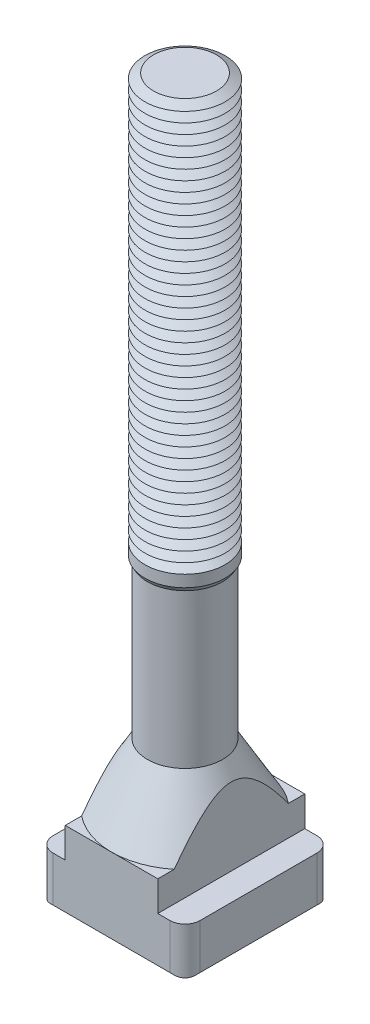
ISO-10303-21;
HEADER;
FILE_DESCRIPTION(('STEP AP214'),'2;1');
FILE_NAME('part.step','',(''),(''),'','','');
FILE_SCHEMA(('AUTOMOTIVE_DESIGN { 1 0 10303 214 1 1 1 1 }'));
ENDSEC;
DATA;
#1=APPLICATION_CONTEXT('core data for automotive mechanical design processes');
#2=APPLICATION_PROTOCOL_DEFINITION('international standard','automotive_design',2000,#1);
#3=PRODUCT_CONTEXT('',#1,'mechanical');
#4=PRODUCT('Part','Part','',(#3));
#5=PRODUCT_RELATED_PRODUCT_CATEGORY('part','',(#4));
#6=PRODUCT_DEFINITION_FORMATION('','',#4);
#7=PRODUCT_DEFINITION_CONTEXT('part definition',#1,'design');
#8=PRODUCT_DEFINITION('design','',#6,#7);
#9=PRODUCT_DEFINITION_SHAPE('','',#8);
#10=(LENGTH_UNIT() NAMED_UNIT(*) SI_UNIT(.MILLI.,.METRE.));
#11=(NAMED_UNIT(*) PLANE_ANGLE_UNIT() SI_UNIT($,.RADIAN.));
#12=(NAMED_UNIT(*) SI_UNIT($,.STERADIAN.) SOLID_ANGLE_UNIT());
#13=UNCERTAINTY_MEASURE_WITH_UNIT(LENGTH_MEASURE(1.E-05),#10,'distance_accuracy_value','');
#14=(GEOMETRIC_REPRESENTATION_CONTEXT(3) GLOBAL_UNCERTAINTY_ASSIGNED_CONTEXT((#13)) GLOBAL_UNIT_ASSIGNED_CONTEXT((#10,
#11,#12)) REPRESENTATION_CONTEXT('',''));
#15=CARTESIAN_POINT('',(0.,0.,0.));
#16=DIRECTION('',(0.,0.,1.));
#17=DIRECTION('',(1.,0.,0.));
#18=AXIS2_PLACEMENT_3D('',#15,#16,#17);
#19=CARTESIAN_POINT('',(0.,206.,0.));
#20=DIRECTION('',(0.,-1.,0.));
#21=DIRECTION('',(0.,0.,-1.));
#22=AXIS2_PLACEMENT_3D('',#19,#20,#21);
#23=CONICAL_SURFACE('',#22,9.4019237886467,1.0471975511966);
#24=CARTESIAN_POINT('',(0.,204.5,0.));
#25=DIRECTION('',(0.,-1.,0.));
#26=DIRECTION('',(0.,0.,-1.));
#27=AXIS2_PLACEMENT_3D('',#24,#25,#26);
#28=CIRCLE('',#27,12.);
#29=CARTESIAN_POINT('',(0.,204.5,-12.));
#30=VERTEX_POINT('',#29);
#31=EDGE_CURVE('E720',#30,#30,#28,.T.);
#32=ORIENTED_EDGE('',*,*,#31,.F.);
#33=EDGE_LOOP('',(#32));
#34=FACE_BOUND('',#33,.T.);
#35=CARTESIAN_POINT('',(0.,206.,0.));
#36=DIRECTION('',(0.,-1.,0.));
#37=DIRECTION('',(0.,0.,-1.));
#38=AXIS2_PLACEMENT_3D('',#35,#36,#37);
#39=CIRCLE('',#38,9.4019237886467);
#40=CARTESIAN_POINT('',(0.,206.,-9.4019237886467));
#41=VERTEX_POINT('',#40);
#42=EDGE_CURVE('E631',#41,#41,#39,.T.);
#43=ORIENTED_EDGE('',*,*,#42,.T.);
#44=EDGE_LOOP('',(#43));
#45=FACE_BOUND('',#44,.T.);
#46=ADVANCED_FACE('F39',(#34,#45),#23,.T.);
#47=CARTESIAN_POINT('',(0.,207.5,0.));
#48=DIRECTION('',(0.,1.,0.));
#49=DIRECTION('',(0.,0.,1.));
#50=AXIS2_PLACEMENT_3D('',#47,#48,#49);
#51=CONICAL_SURFACE('',#50,12.,1.0471975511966);
#52=ORIENTED_EDGE('',*,*,#42,.F.);
#53=EDGE_LOOP('',(#52));
#54=FACE_BOUND('',#53,.T.);
#55=CARTESIAN_POINT('',(0.,207.5,0.));
#56=DIRECTION('',(0.,-1.,0.));
#57=DIRECTION('',(0.,0.,-1.));
#58=AXIS2_PLACEMENT_3D('',#55,#56,#57);
#59=CIRCLE('',#58,12.);
#60=CARTESIAN_POINT('',(0.,207.5,-12.));
#61=VERTEX_POINT('',#60);
#62=EDGE_CURVE('E774',#61,#61,#59,.T.);
#63=ORIENTED_EDGE('',*,*,#62,.T.);
#64=EDGE_LOOP('',(#63));
#65=FACE_BOUND('',#64,.T.);
#66=ADVANCED_FACE('F448',(#54,#65),#51,.T.);
#67=CARTESIAN_POINT('',(5.26156946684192,218.,0.));
#68=DIRECTION('',(0.,-1.,0.));
#69=DIRECTION('',(1.,0.,0.));
#70=AXIS2_PLACEMENT_3D('',#67,#68,#69);
#71=PLANE('',#70);
#72=CARTESIAN_POINT('',(0.,218.,0.));
#73=DIRECTION('',(0.,-1.,0.));
#74=DIRECTION('',(0.,0.,-1.));
#75=AXIS2_PLACEMENT_3D('',#72,#73,#74);
#76=CIRCLE('',#75,9.4019237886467);
#77=CARTESIAN_POINT('',(0.,218.,-9.4019237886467));
#78=VERTEX_POINT('',#77);
#79=EDGE_CURVE('E802',#78,#78,#76,.T.);
#80=ORIENTED_EDGE('',*,*,#79,.F.);
#81=EDGE_LOOP('',(#80));
#82=FACE_BOUND('',#81,.T.);
#83=ADVANCED_FACE('F454',(#82),#71,.F.);
#84=CARTESIAN_POINT('',(0.,218.,0.));
#85=DIRECTION('',(0.,-1.,0.));
#86=DIRECTION('',(0.,0.,-1.));
#87=AXIS2_PLACEMENT_3D('',#84,#85,#86);
#88=CONICAL_SURFACE('',#87,9.4019237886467,1.0471975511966);
#89=CARTESIAN_POINT('',(0.,216.5,0.));
#90=DIRECTION('',(0.,-1.,0.));
#91=DIRECTION('',(0.,0.,-1.));
#92=AXIS2_PLACEMENT_3D('',#89,#90,#91);
#93=CIRCLE('',#92,12.);
#94=CARTESIAN_POINT('',(0.,216.5,-12.));
#95=VERTEX_POINT('',#94);
#96=EDGE_CURVE('E800',#95,#95,#93,.T.);
#97=ORIENTED_EDGE('',*,*,#96,.F.);
#98=EDGE_LOOP('',(#97));
#99=FACE_BOUND('',#98,.T.);
#100=ORIENTED_EDGE('',*,*,#79,.T.);
#101=EDGE_LOOP('',(#100));
#102=FACE_BOUND('',#101,.T.);
#103=ADVANCED_FACE('F482',(#99,#102),#88,.T.);
#104=CARTESIAN_POINT('',(0.,216.5,0.));
#105=DIRECTION('',(0.,1.,0.));
#106=DIRECTION('',(0.,0.,1.));
#107=AXIS2_PLACEMENT_3D('',#104,#105,#106);
#108=CONICAL_SURFACE('',#107,12.,1.0471975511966);
#109=CARTESIAN_POINT('',(0.,215.,0.));
#110=DIRECTION('',(0.,-1.,0.));
#111=DIRECTION('',(0.,0.,-1.));
#112=AXIS2_PLACEMENT_3D('',#109,#110,#111);
#113=CIRCLE('',#112,9.4019237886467);
#114=CARTESIAN_POINT('',(0.,215.,-9.4019237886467));
#115=VERTEX_POINT('',#114);
#116=EDGE_CURVE('E803',#115,#115,#113,.T.);
#117=ORIENTED_EDGE('',*,*,#116,.F.);
#118=EDGE_LOOP('',(#117));
#119=FACE_BOUND('',#118,.T.);
#120=ORIENTED_EDGE('',*,*,#96,.T.);
#121=EDGE_LOOP('',(#120));
#122=FACE_BOUND('',#121,.T.);
#123=ADVANCED_FACE('F479',(#119,#122),#108,.T.);
#124=CARTESIAN_POINT('',(0.,215.,0.));
#125=DIRECTION('',(0.,-1.,0.));
#126=DIRECTION('',(0.,0.,-1.));
#127=AXIS2_PLACEMENT_3D('',#124,#125,#126);
#128=CONICAL_SURFACE('',#127,9.4019237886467,1.0471975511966);
#129=CARTESIAN_POINT('',(0.,213.5,0.));
#130=DIRECTION('',(0.,-1.,0.));
#131=DIRECTION('',(0.,0.,-1.));
#132=AXIS2_PLACEMENT_3D('',#129,#130,#131);
#133=CIRCLE('',#132,12.);
#134=CARTESIAN_POINT('',(0.,213.5,-12.));
#135=VERTEX_POINT('',#134);
#136=EDGE_CURVE('E813',#135,#135,#133,.T.);
#137=ORIENTED_EDGE('',*,*,#136,.F.);
#138=EDGE_LOOP('',(#137));
#139=FACE_BOUND('',#138,.T.);
#140=ORIENTED_EDGE('',*,*,#116,.T.);
#141=EDGE_LOOP('',(#140));
#142=FACE_BOUND('',#141,.T.);
#143=ADVANCED_FACE('F474',(#139,#142),#128,.T.);
#144=CARTESIAN_POINT('',(0.,213.5,0.));
#145=DIRECTION('',(0.,1.,0.));
#146=DIRECTION('',(0.,0.,1.));
#147=AXIS2_PLACEMENT_3D('',#144,#145,#146);
#148=CONICAL_SURFACE('',#147,12.,1.0471975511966);
#149=CARTESIAN_POINT('',(0.,212.,0.));
#150=DIRECTION('',(0.,-1.,0.));
#151=DIRECTION('',(0.,0.,-1.));
#152=AXIS2_PLACEMENT_3D('',#149,#150,#151);
#153=CIRCLE('',#152,9.4019237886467);
#154=CARTESIAN_POINT('',(0.,212.,-9.4019237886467));
#155=VERTEX_POINT('',#154);
#156=EDGE_CURVE('E742',#155,#155,#153,.T.);
#157=ORIENTED_EDGE('',*,*,#156,.F.);
#158=EDGE_LOOP('',(#157));
#159=FACE_BOUND('',#158,.T.);
#160=ORIENTED_EDGE('',*,*,#136,.T.);
#161=EDGE_LOOP('',(#160));
#162=FACE_BOUND('',#161,.T.);
#163=ADVANCED_FACE('F471',(#159,#162),#148,.T.);
#164=CARTESIAN_POINT('',(0.,212.,0.));
#165=DIRECTION('',(0.,-1.,0.));
#166=DIRECTION('',(0.,0.,-1.));
#167=AXIS2_PLACEMENT_3D('',#164,#165,#166);
#168=CONICAL_SURFACE('',#167,9.4019237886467,1.0471975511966);
#169=CARTESIAN_POINT('',(0.,210.5,0.));
#170=DIRECTION('',(0.,-1.,0.));
#171=DIRECTION('',(0.,0.,-1.));
#172=AXIS2_PLACEMENT_3D('',#169,#170,#171);
#173=CIRCLE('',#172,12.);
#174=CARTESIAN_POINT('',(0.,210.5,-12.));
#175=VERTEX_POINT('',#174);
#176=EDGE_CURVE('E740',#175,#175,#173,.T.);
#177=ORIENTED_EDGE('',*,*,#176,.F.);
#178=EDGE_LOOP('',(#177));
#179=FACE_BOUND('',#178,.T.);
#180=ORIENTED_EDGE('',*,*,#156,.T.);
#181=EDGE_LOOP('',(#180));
#182=FACE_BOUND('',#181,.T.);
#183=ADVANCED_FACE('F465',(#179,#182),#168,.T.);
#184=CARTESIAN_POINT('',(0.,210.5,0.));
#185=DIRECTION('',(0.,1.,0.));
#186=DIRECTION('',(0.,0.,1.));
#187=AXIS2_PLACEMENT_3D('',#184,#185,#186);
#188=CONICAL_SURFACE('',#187,12.,1.0471975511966);
#189=CARTESIAN_POINT('',(0.,209.,0.));
#190=DIRECTION('',(0.,-1.,0.));
#191=DIRECTION('',(0.,0.,-1.));
#192=AXIS2_PLACEMENT_3D('',#189,#190,#191);
#193=CIRCLE('',#192,9.4019237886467);
#194=CARTESIAN_POINT('',(0.,209.,-9.4019237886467));
#195=VERTEX_POINT('',#194);
#196=EDGE_CURVE('E743',#195,#195,#193,.T.);
#197=ORIENTED_EDGE('',*,*,#196,.F.);
#198=EDGE_LOOP('',(#197));
#199=FACE_BOUND('',#198,.T.);
#200=ORIENTED_EDGE('',*,*,#176,.T.);
#201=EDGE_LOOP('',(#200));
#202=FACE_BOUND('',#201,.T.);
#203=ADVANCED_FACE('F461',(#199,#202),#188,.T.);
#204=CARTESIAN_POINT('',(0.,209.,0.));
#205=DIRECTION('',(0.,-1.,0.));
#206=DIRECTION('',(0.,0.,-1.));
#207=AXIS2_PLACEMENT_3D('',#204,#205,#206);
#208=CONICAL_SURFACE('',#207,9.4019237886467,1.0471975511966);
#209=ORIENTED_EDGE('',*,*,#62,.F.);
#210=EDGE_LOOP('',(#209));
#211=FACE_BOUND('',#210,.T.);
#212=ORIENTED_EDGE('',*,*,#196,.T.);
#213=EDGE_LOOP('',(#212));
#214=FACE_BOUND('',#213,.T.);
#215=ADVANCED_FACE('F464',(#211,#214),#208,.T.);
#216=CARTESIAN_POINT('',(0.,203.,0.));
#217=DIRECTION('',(0.,-1.,0.));
#218=DIRECTION('',(0.,0.,-1.));
#219=AXIS2_PLACEMENT_3D('',#216,#217,#218);
#220=CONICAL_SURFACE('',#219,9.4019237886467,1.0471975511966);
#221=CARTESIAN_POINT('',(0.,201.5,0.));
#222=DIRECTION('',(0.,-1.,0.));
#223=DIRECTION('',(0.,0.,-1.));
#224=AXIS2_PLACEMENT_3D('',#221,#222,#223);
#225=CIRCLE('',#224,12.);
#226=CARTESIAN_POINT('',(0.,201.5,-12.));
#227=VERTEX_POINT('',#226);
#228=EDGE_CURVE('E721',#227,#227,#225,.T.);
#229=ORIENTED_EDGE('',*,*,#228,.F.);
#230=EDGE_LOOP('',(#229));
#231=FACE_BOUND('',#230,.T.);
#232=CARTESIAN_POINT('',(0.,203.,0.));
#233=DIRECTION('',(0.,-1.,0.));
#234=DIRECTION('',(0.,0.,-1.));
#235=AXIS2_PLACEMENT_3D('',#232,#233,#234);
#236=CIRCLE('',#235,9.4019237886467);
#237=CARTESIAN_POINT('',(0.,203.,-9.4019237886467));
#238=VERTEX_POINT('',#237);
#239=EDGE_CURVE('E718',#238,#238,#236,.T.);
#240=ORIENTED_EDGE('',*,*,#239,.T.);
#241=EDGE_LOOP('',(#240));
#242=FACE_BOUND('',#241,.T.);
#243=ADVANCED_FACE('F469',(#231,#242),#220,.T.);
#244=CARTESIAN_POINT('',(0.,204.5,0.));
#245=DIRECTION('',(0.,1.,0.));
#246=DIRECTION('',(0.,0.,1.));
#247=AXIS2_PLACEMENT_3D('',#244,#245,#246);
#248=CONICAL_SURFACE('',#247,12.,1.0471975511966);
#249=ORIENTED_EDGE('',*,*,#239,.F.);
#250=EDGE_LOOP('',(#249));
#251=FACE_BOUND('',#250,.T.);
#252=ORIENTED_EDGE('',*,*,#31,.T.);
#253=EDGE_LOOP('',(#252));
#254=FACE_BOUND('',#253,.T.);
#255=ADVANCED_FACE('F1654',(#251,#254),#248,.T.);
#256=CARTESIAN_POINT('',(0.,200.,0.));
#257=DIRECTION('',(0.,-1.,0.));
#258=DIRECTION('',(0.,0.,-1.));
#259=AXIS2_PLACEMENT_3D('',#256,#257,#258);
#260=CONICAL_SURFACE('',#259,9.4019237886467,1.0471975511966);
#261=CARTESIAN_POINT('',(0.,198.5,0.));
#262=DIRECTION('',(0.,-1.,0.));
#263=DIRECTION('',(0.,0.,-1.));
#264=AXIS2_PLACEMENT_3D('',#261,#262,#263);
#265=CIRCLE('',#264,12.);
#266=CARTESIAN_POINT('',(0.,198.5,-12.));
#267=VERTEX_POINT('',#266);
#268=EDGE_CURVE('E689',#267,#267,#265,.T.);
#269=ORIENTED_EDGE('',*,*,#268,.F.);
#270=EDGE_LOOP('',(#269));
#271=FACE_BOUND('',#270,.T.);
#272=CARTESIAN_POINT('',(0.,200.,0.));
#273=DIRECTION('',(0.,-1.,0.));
#274=DIRECTION('',(0.,0.,-1.));
#275=AXIS2_PLACEMENT_3D('',#272,#273,#274);
#276=CIRCLE('',#275,9.4019237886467);
#277=CARTESIAN_POINT('',(0.,200.,-9.4019237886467));
#278=VERTEX_POINT('',#277);
#279=EDGE_CURVE('E691',#278,#278,#276,.T.);
#280=ORIENTED_EDGE('',*,*,#279,.T.);
#281=EDGE_LOOP('',(#280));
#282=FACE_BOUND('',#281,.T.);
#283=ADVANCED_FACE('F1644',(#271,#282),#260,.T.);
#284=CARTESIAN_POINT('',(0.,201.5,0.));
#285=DIRECTION('',(0.,1.,0.));
#286=DIRECTION('',(0.,0.,1.));
#287=AXIS2_PLACEMENT_3D('',#284,#285,#286);
#288=CONICAL_SURFACE('',#287,12.,1.0471975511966);
#289=ORIENTED_EDGE('',*,*,#279,.F.);
#290=EDGE_LOOP('',(#289));
#291=FACE_BOUND('',#290,.T.);
#292=ORIENTED_EDGE('',*,*,#228,.T.);
#293=EDGE_LOOP('',(#292));
#294=FACE_BOUND('',#293,.T.);
#295=ADVANCED_FACE('F1634',(#291,#294),#288,.T.);
#296=CARTESIAN_POINT('',(0.,197.,0.));
#297=DIRECTION('',(0.,-1.,0.));
#298=DIRECTION('',(0.,0.,-1.));
#299=AXIS2_PLACEMENT_3D('',#296,#297,#298);
#300=CONICAL_SURFACE('',#299,9.4019237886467,1.0471975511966);
#301=CARTESIAN_POINT('',(0.,195.5,0.));
#302=DIRECTION('',(0.,-1.,0.));
#303=DIRECTION('',(0.,0.,-1.));
#304=AXIS2_PLACEMENT_3D('',#301,#302,#303);
#305=CIRCLE('',#304,12.);
#306=CARTESIAN_POINT('',(0.,195.5,-12.));
#307=VERTEX_POINT('',#306);
#308=EDGE_CURVE('E772',#307,#307,#305,.T.);
#309=ORIENTED_EDGE('',*,*,#308,.F.);
#310=EDGE_LOOP('',(#309));
#311=FACE_BOUND('',#310,.T.);
#312=CARTESIAN_POINT('',(0.,197.,0.));
#313=DIRECTION('',(0.,-1.,0.));
#314=DIRECTION('',(0.,0.,-1.));
#315=AXIS2_PLACEMENT_3D('',#312,#313,#314);
#316=CIRCLE('',#315,9.4019237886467);
#317=CARTESIAN_POINT('',(0.,197.,-9.4019237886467));
#318=VERTEX_POINT('',#317);
#319=EDGE_CURVE('E692',#318,#318,#316,.T.);
#320=ORIENTED_EDGE('',*,*,#319,.T.);
#321=EDGE_LOOP('',(#320));
#322=FACE_BOUND('',#321,.T.);
#323=ADVANCED_FACE('F1624',(#311,#322),#300,.T.);
#324=CARTESIAN_POINT('',(0.,198.5,0.));
#325=DIRECTION('',(0.,1.,0.));
#326=DIRECTION('',(0.,0.,1.));
#327=AXIS2_PLACEMENT_3D('',#324,#325,#326);
#328=CONICAL_SURFACE('',#327,12.,1.0471975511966);
#329=ORIENTED_EDGE('',*,*,#319,.F.);
#330=EDGE_LOOP('',(#329));
#331=FACE_BOUND('',#330,.T.);
#332=ORIENTED_EDGE('',*,*,#268,.T.);
#333=EDGE_LOOP('',(#332));
#334=FACE_BOUND('',#333,.T.);
#335=ADVANCED_FACE('F1614',(#331,#334),#328,.T.);
#336=CARTESIAN_POINT('',(0.,194.,0.));
#337=DIRECTION('',(0.,-1.,0.));
#338=DIRECTION('',(0.,0.,-1.));
#339=AXIS2_PLACEMENT_3D('',#336,#337,#338);
#340=CONICAL_SURFACE('',#339,9.4019237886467,1.0471975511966);
#341=CARTESIAN_POINT('',(0.,192.5,0.));
#342=DIRECTION('',(0.,-1.,0.));
#343=DIRECTION('',(0.,0.,-1.));
#344=AXIS2_PLACEMENT_3D('',#341,#342,#343);
#345=CIRCLE('',#344,12.);
#346=CARTESIAN_POINT('',(0.,192.5,-12.));
#347=VERTEX_POINT('',#346);
#348=EDGE_CURVE('E652',#347,#347,#345,.T.);
#349=ORIENTED_EDGE('',*,*,#348,.F.);
#350=EDGE_LOOP('',(#349));
#351=FACE_BOUND('',#350,.T.);
#352=CARTESIAN_POINT('',(0.,194.,0.));
#353=DIRECTION('',(0.,-1.,0.));
#354=DIRECTION('',(0.,0.,-1.));
#355=AXIS2_PLACEMENT_3D('',#352,#353,#354);
#356=CIRCLE('',#355,9.4019237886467);
#357=CARTESIAN_POINT('',(0.,194.,-9.4019237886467));
#358=VERTEX_POINT('',#357);
#359=EDGE_CURVE('E655',#358,#358,#356,.T.);
#360=ORIENTED_EDGE('',*,*,#359,.T.);
#361=EDGE_LOOP('',(#360));
#362=FACE_BOUND('',#361,.T.);
#363=ADVANCED_FACE('F1604',(#351,#362),#340,.T.);
#364=CARTESIAN_POINT('',(0.,195.5,0.));
#365=DIRECTION('',(0.,1.,0.));
#366=DIRECTION('',(0.,0.,1.));
#367=AXIS2_PLACEMENT_3D('',#364,#365,#366);
#368=CONICAL_SURFACE('',#367,12.,1.0471975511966);
#369=ORIENTED_EDGE('',*,*,#359,.F.);
#370=EDGE_LOOP('',(#369));
#371=FACE_BOUND('',#370,.T.);
#372=ORIENTED_EDGE('',*,*,#308,.T.);
#373=EDGE_LOOP('',(#372));
#374=FACE_BOUND('',#373,.T.);
#375=ADVANCED_FACE('F1594',(#371,#374),#368,.T.);
#376=CARTESIAN_POINT('',(0.,191.,0.));
#377=DIRECTION('',(0.,-1.,0.));
#378=DIRECTION('',(0.,0.,-1.));
#379=AXIS2_PLACEMENT_3D('',#376,#377,#378);
#380=CONICAL_SURFACE('',#379,9.4019237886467,1.0471975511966);
#381=CARTESIAN_POINT('',(0.,189.5,0.));
#382=DIRECTION('',(0.,-1.,0.));
#383=DIRECTION('',(0.,0.,-1.));
#384=AXIS2_PLACEMENT_3D('',#381,#382,#383);
#385=CIRCLE('',#384,12.);
#386=CARTESIAN_POINT('',(0.,189.5,-12.));
#387=VERTEX_POINT('',#386);
#388=EDGE_CURVE('E765',#387,#387,#385,.T.);
#389=ORIENTED_EDGE('',*,*,#388,.F.);
#390=EDGE_LOOP('',(#389));
#391=FACE_BOUND('',#390,.T.);
#392=CARTESIAN_POINT('',(0.,191.,0.));
#393=DIRECTION('',(0.,-1.,0.));
#394=DIRECTION('',(0.,0.,-1.));
#395=AXIS2_PLACEMENT_3D('',#392,#393,#394);
#396=CIRCLE('',#395,9.4019237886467);
#397=CARTESIAN_POINT('',(0.,191.,-9.4019237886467));
#398=VERTEX_POINT('',#397);
#399=EDGE_CURVE('E656',#398,#398,#396,.T.);
#400=ORIENTED_EDGE('',*,*,#399,.T.);
#401=EDGE_LOOP('',(#400));
#402=FACE_BOUND('',#401,.T.);
#403=ADVANCED_FACE('F1584',(#391,#402),#380,.T.);
#404=CARTESIAN_POINT('',(0.,192.5,0.));
#405=DIRECTION('',(0.,1.,0.));
#406=DIRECTION('',(0.,0.,1.));
#407=AXIS2_PLACEMENT_3D('',#404,#405,#406);
#408=CONICAL_SURFACE('',#407,12.,1.0471975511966);
#409=ORIENTED_EDGE('',*,*,#399,.F.);
#410=EDGE_LOOP('',(#409));
#411=FACE_BOUND('',#410,.T.);
#412=ORIENTED_EDGE('',*,*,#348,.T.);
#413=EDGE_LOOP('',(#412));
#414=FACE_BOUND('',#413,.T.);
#415=ADVANCED_FACE('F1574',(#411,#414),#408,.T.);
#416=CARTESIAN_POINT('',(0.,188.,0.));
#417=DIRECTION('',(0.,-1.,0.));
#418=DIRECTION('',(0.,0.,-1.));
#419=AXIS2_PLACEMENT_3D('',#416,#417,#418);
#420=CONICAL_SURFACE('',#419,9.4019237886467,1.0471975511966);
#421=CARTESIAN_POINT('',(0.,186.5,0.));
#422=DIRECTION('',(0.,-1.,0.));
#423=DIRECTION('',(0.,0.,-1.));
#424=AXIS2_PLACEMENT_3D('',#421,#422,#423);
#425=CIRCLE('',#424,12.);
#426=CARTESIAN_POINT('',(0.,186.5,-12.));
#427=VERTEX_POINT('',#426);
#428=EDGE_CURVE('E1935',#427,#427,#425,.T.);
#429=ORIENTED_EDGE('',*,*,#428,.F.);
#430=EDGE_LOOP('',(#429));
#431=FACE_BOUND('',#430,.T.);
#432=CARTESIAN_POINT('',(0.,188.,0.));
#433=DIRECTION('',(0.,-1.,0.));
#434=DIRECTION('',(0.,0.,-1.));
#435=AXIS2_PLACEMENT_3D('',#432,#433,#434);
#436=CIRCLE('',#435,9.4019237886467);
#437=CARTESIAN_POINT('',(0.,188.,-9.4019237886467));
#438=VERTEX_POINT('',#437);
#439=EDGE_CURVE('E768',#438,#438,#436,.T.);
#440=ORIENTED_EDGE('',*,*,#439,.T.);
#441=EDGE_LOOP('',(#440));
#442=FACE_BOUND('',#441,.T.);
#443=ADVANCED_FACE('F1564',(#431,#442),#420,.T.);
#444=CARTESIAN_POINT('',(0.,189.5,0.));
#445=DIRECTION('',(0.,1.,0.));
#446=DIRECTION('',(0.,0.,1.));
#447=AXIS2_PLACEMENT_3D('',#444,#445,#446);
#448=CONICAL_SURFACE('',#447,12.,1.0471975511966);
#449=ORIENTED_EDGE('',*,*,#439,.F.);
#450=EDGE_LOOP('',(#449));
#451=FACE_BOUND('',#450,.T.);
#452=ORIENTED_EDGE('',*,*,#388,.T.);
#453=EDGE_LOOP('',(#452));
#454=FACE_BOUND('',#453,.T.);
#455=ADVANCED_FACE('F1554',(#451,#454),#448,.T.);
#456=CARTESIAN_POINT('',(0.,185.,0.));
#457=DIRECTION('',(0.,-1.,0.));
#458=DIRECTION('',(0.,0.,-1.));
#459=AXIS2_PLACEMENT_3D('',#456,#457,#458);
#460=CONICAL_SURFACE('',#459,9.4019237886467,1.0471975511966);
#461=CARTESIAN_POINT('',(0.,183.5,0.));
#462=DIRECTION('',(0.,-1.,0.));
#463=DIRECTION('',(0.,0.,-1.));
#464=AXIS2_PLACEMENT_3D('',#461,#462,#463);
#465=CIRCLE('',#464,12.);
#466=CARTESIAN_POINT('',(0.,183.5,-12.));
#467=VERTEX_POINT('',#466);
#468=EDGE_CURVE('E712',#467,#467,#465,.T.);
#469=ORIENTED_EDGE('',*,*,#468,.F.);
#470=EDGE_LOOP('',(#469));
#471=FACE_BOUND('',#470,.T.);
#472=CARTESIAN_POINT('',(0.,185.,0.));
#473=DIRECTION('',(0.,-1.,0.));
#474=DIRECTION('',(0.,0.,-1.));
#475=AXIS2_PLACEMENT_3D('',#472,#473,#474);
#476=CIRCLE('',#475,9.4019237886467);
#477=CARTESIAN_POINT('',(0.,185.,-9.4019237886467));
#478=VERTEX_POINT('',#477);
#479=EDGE_CURVE('E715',#478,#478,#476,.T.);
#480=ORIENTED_EDGE('',*,*,#479,.T.);
#481=EDGE_LOOP('',(#480));
#482=FACE_BOUND('',#481,.T.);
#483=ADVANCED_FACE('F1544',(#471,#482),#460,.T.);
#484=CARTESIAN_POINT('',(0.,186.5,0.));
#485=DIRECTION('',(0.,1.,0.));
#486=DIRECTION('',(0.,0.,1.));
#487=AXIS2_PLACEMENT_3D('',#484,#485,#486);
#488=CONICAL_SURFACE('',#487,12.,1.0471975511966);
#489=ORIENTED_EDGE('',*,*,#479,.F.);
#490=EDGE_LOOP('',(#489));
#491=FACE_BOUND('',#490,.T.);
#492=ORIENTED_EDGE('',*,*,#428,.T.);
#493=EDGE_LOOP('',(#492));
#494=FACE_BOUND('',#493,.T.);
#495=ADVANCED_FACE('F1534',(#491,#494),#488,.T.);
#496=CARTESIAN_POINT('',(0.,182.,0.));
#497=DIRECTION('',(0.,-1.,0.));
#498=DIRECTION('',(0.,0.,-1.));
#499=AXIS2_PLACEMENT_3D('',#496,#497,#498);
#500=CONICAL_SURFACE('',#499,9.4019237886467,1.0471975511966);
#501=CARTESIAN_POINT('',(0.,180.5,0.));
#502=DIRECTION('',(0.,-1.,0.));
#503=DIRECTION('',(0.,0.,-1.));
#504=AXIS2_PLACEMENT_3D('',#501,#502,#503);
#505=CIRCLE('',#504,12.);
#506=CARTESIAN_POINT('',(0.,180.5,-12.));
#507=VERTEX_POINT('',#506);
#508=EDGE_CURVE('E669',#507,#507,#505,.T.);
#509=ORIENTED_EDGE('',*,*,#508,.F.);
#510=EDGE_LOOP('',(#509));
#511=FACE_BOUND('',#510,.T.);
#512=CARTESIAN_POINT('',(0.,182.,0.));
#513=DIRECTION('',(0.,-1.,0.));
#514=DIRECTION('',(0.,0.,-1.));
#515=AXIS2_PLACEMENT_3D('',#512,#513,#514);
#516=CIRCLE('',#515,9.4019237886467);
#517=CARTESIAN_POINT('',(0.,182.,-9.4019237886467));
#518=VERTEX_POINT('',#517);
#519=EDGE_CURVE('E716',#518,#518,#516,.T.);
#520=ORIENTED_EDGE('',*,*,#519,.T.);
#521=EDGE_LOOP('',(#520));
#522=FACE_BOUND('',#521,.T.);
#523=ADVANCED_FACE('F1524',(#511,#522),#500,.T.);
#524=CARTESIAN_POINT('',(0.,183.5,0.));
#525=DIRECTION('',(0.,1.,0.));
#526=DIRECTION('',(0.,0.,1.));
#527=AXIS2_PLACEMENT_3D('',#524,#525,#526);
#528=CONICAL_SURFACE('',#527,12.,1.0471975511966);
#529=ORIENTED_EDGE('',*,*,#519,.F.);
#530=EDGE_LOOP('',(#529));
#531=FACE_BOUND('',#530,.T.);
#532=ORIENTED_EDGE('',*,*,#468,.T.);
#533=EDGE_LOOP('',(#532));
#534=FACE_BOUND('',#533,.T.);
#535=ADVANCED_FACE('F1514',(#531,#534),#528,.T.);
#536=CARTESIAN_POINT('',(0.,179.,0.));
#537=DIRECTION('',(0.,-1.,0.));
#538=DIRECTION('',(0.,0.,-1.));
#539=AXIS2_PLACEMENT_3D('',#536,#537,#538);
#540=CONICAL_SURFACE('',#539,9.4019237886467,1.0471975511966);
#541=CARTESIAN_POINT('',(0.,177.5,0.));
#542=DIRECTION('',(0.,-1.,0.));
#543=DIRECTION('',(0.,0.,-1.));
#544=AXIS2_PLACEMENT_3D('',#541,#542,#543);
#545=CIRCLE('',#544,12.);
#546=CARTESIAN_POINT('',(0.,177.5,-12.));
#547=VERTEX_POINT('',#546);
#548=EDGE_CURVE('E670',#547,#547,#545,.T.);
#549=ORIENTED_EDGE('',*,*,#548,.F.);
#550=EDGE_LOOP('',(#549));
#551=FACE_BOUND('',#550,.T.);
#552=CARTESIAN_POINT('',(0.,179.,0.));
#553=DIRECTION('',(0.,-1.,0.));
#554=DIRECTION('',(0.,0.,-1.));
#555=AXIS2_PLACEMENT_3D('',#552,#553,#554);
#556=CIRCLE('',#555,9.4019237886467);
#557=CARTESIAN_POINT('',(0.,179.,-9.4019237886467));
#558=VERTEX_POINT('',#557);
#559=EDGE_CURVE('E667',#558,#558,#556,.T.);
#560=ORIENTED_EDGE('',*,*,#559,.T.);
#561=EDGE_LOOP('',(#560));
#562=FACE_BOUND('',#561,.T.);
#563=ADVANCED_FACE('F1504',(#551,#562),#540,.T.);
#564=CARTESIAN_POINT('',(0.,180.5,0.));
#565=DIRECTION('',(0.,1.,0.));
#566=DIRECTION('',(0.,0.,1.));
#567=AXIS2_PLACEMENT_3D('',#564,#565,#566);
#568=CONICAL_SURFACE('',#567,12.,1.0471975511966);
#569=ORIENTED_EDGE('',*,*,#559,.F.);
#570=EDGE_LOOP('',(#569));
#571=FACE_BOUND('',#570,.T.);
#572=ORIENTED_EDGE('',*,*,#508,.T.);
#573=EDGE_LOOP('',(#572));
#574=FACE_BOUND('',#573,.T.);
#575=ADVANCED_FACE('F1494',(#571,#574),#568,.T.);
#576=CARTESIAN_POINT('',(0.,176.,0.));
#577=DIRECTION('',(0.,-1.,0.));
#578=DIRECTION('',(0.,0.,-1.));
#579=AXIS2_PLACEMENT_3D('',#576,#577,#578);
#580=CONICAL_SURFACE('',#579,9.4019237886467,1.0471975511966);
#581=CARTESIAN_POINT('',(0.,174.5,0.));
#582=DIRECTION('',(0.,-1.,0.));
#583=DIRECTION('',(0.,0.,-1.));
#584=AXIS2_PLACEMENT_3D('',#581,#582,#583);
#585=CIRCLE('',#584,12.);
#586=CARTESIAN_POINT('',(0.,174.5,-12.));
#587=VERTEX_POINT('',#586);
#588=EDGE_CURVE('E794',#587,#587,#585,.T.);
#589=ORIENTED_EDGE('',*,*,#588,.F.);
#590=EDGE_LOOP('',(#589));
#591=FACE_BOUND('',#590,.T.);
#592=CARTESIAN_POINT('',(0.,176.,0.));
#593=DIRECTION('',(0.,-1.,0.));
#594=DIRECTION('',(0.,0.,-1.));
#595=AXIS2_PLACEMENT_3D('',#592,#593,#594);
#596=CIRCLE('',#595,9.4019237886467);
#597=CARTESIAN_POINT('',(0.,176.,-9.4019237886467));
#598=VERTEX_POINT('',#597);
#599=EDGE_CURVE('E797',#598,#598,#596,.T.);
#600=ORIENTED_EDGE('',*,*,#599,.T.);
#601=EDGE_LOOP('',(#600));
#602=FACE_BOUND('',#601,.T.);
#603=ADVANCED_FACE('F1484',(#591,#602),#580,.T.);
#604=CARTESIAN_POINT('',(0.,177.5,0.));
#605=DIRECTION('',(0.,1.,0.));
#606=DIRECTION('',(0.,0.,1.));
#607=AXIS2_PLACEMENT_3D('',#604,#605,#606);
#608=CONICAL_SURFACE('',#607,12.,1.0471975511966);
#609=ORIENTED_EDGE('',*,*,#599,.F.);
#610=EDGE_LOOP('',(#609));
#611=FACE_BOUND('',#610,.T.);
#612=ORIENTED_EDGE('',*,*,#548,.T.);
#613=EDGE_LOOP('',(#612));
#614=FACE_BOUND('',#613,.T.);
#615=ADVANCED_FACE('F1474',(#611,#614),#608,.T.);
#616=CARTESIAN_POINT('',(0.,173.,0.));
#617=DIRECTION('',(0.,-1.,0.));
#618=DIRECTION('',(0.,0.,-1.));
#619=AXIS2_PLACEMENT_3D('',#616,#617,#618);
#620=CONICAL_SURFACE('',#619,9.4019237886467,1.0471975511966);
#621=CARTESIAN_POINT('',(0.,171.5,0.));
#622=DIRECTION('',(0.,-1.,0.));
#623=DIRECTION('',(0.,0.,-1.));
#624=AXIS2_PLACEMENT_3D('',#621,#622,#623);
#625=CIRCLE('',#624,12.);
#626=CARTESIAN_POINT('',(0.,171.5,-12.));
#627=VERTEX_POINT('',#626);
#628=EDGE_CURVE('E1921',#627,#627,#625,.T.);
#629=ORIENTED_EDGE('',*,*,#628,.F.);
#630=EDGE_LOOP('',(#629));
#631=FACE_BOUND('',#630,.T.);
#632=CARTESIAN_POINT('',(0.,173.,0.));
#633=DIRECTION('',(0.,-1.,0.));
#634=DIRECTION('',(0.,0.,-1.));
#635=AXIS2_PLACEMENT_3D('',#632,#633,#634);
#636=CIRCLE('',#635,9.4019237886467);
#637=CARTESIAN_POINT('',(0.,173.,-9.4019237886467));
#638=VERTEX_POINT('',#637);
#639=EDGE_CURVE('E798',#638,#638,#636,.T.);
#640=ORIENTED_EDGE('',*,*,#639,.T.);
#641=EDGE_LOOP('',(#640));
#642=FACE_BOUND('',#641,.T.);
#643=ADVANCED_FACE('F1464',(#631,#642),#620,.T.);
#644=CARTESIAN_POINT('',(0.,174.5,0.));
#645=DIRECTION('',(0.,1.,0.));
#646=DIRECTION('',(0.,0.,1.));
#647=AXIS2_PLACEMENT_3D('',#644,#645,#646);
#648=CONICAL_SURFACE('',#647,12.,1.0471975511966);
#649=ORIENTED_EDGE('',*,*,#639,.F.);
#650=EDGE_LOOP('',(#649));
#651=FACE_BOUND('',#650,.T.);
#652=ORIENTED_EDGE('',*,*,#588,.T.);
#653=EDGE_LOOP('',(#652));
#654=FACE_BOUND('',#653,.T.);
#655=ADVANCED_FACE('F1454',(#651,#654),#648,.T.);
#656=CARTESIAN_POINT('',(0.,170.,0.));
#657=DIRECTION('',(0.,-1.,0.));
#658=DIRECTION('',(0.,0.,-1.));
#659=AXIS2_PLACEMENT_3D('',#656,#657,#658);
#660=CONICAL_SURFACE('',#659,9.4019237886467,1.0471975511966);
#661=CARTESIAN_POINT('',(0.,168.5,0.));
#662=DIRECTION('',(0.,-1.,0.));
#663=DIRECTION('',(0.,0.,-1.));
#664=AXIS2_PLACEMENT_3D('',#661,#662,#663);
#665=CIRCLE('',#664,12.);
#666=CARTESIAN_POINT('',(0.,168.5,-12.));
#667=VERTEX_POINT('',#666);
#668=EDGE_CURVE('E709',#667,#667,#665,.T.);
#669=ORIENTED_EDGE('',*,*,#668,.F.);
#670=EDGE_LOOP('',(#669));
#671=FACE_BOUND('',#670,.T.);
#672=CARTESIAN_POINT('',(0.,170.,0.));
#673=DIRECTION('',(0.,-1.,0.));
#674=DIRECTION('',(0.,0.,-1.));
#675=AXIS2_PLACEMENT_3D('',#672,#673,#674);
#676=CIRCLE('',#675,9.4019237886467);
#677=CARTESIAN_POINT('',(0.,170.,-9.4019237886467));
#678=VERTEX_POINT('',#677);
#679=EDGE_CURVE('E738',#678,#678,#676,.T.);
#680=ORIENTED_EDGE('',*,*,#679,.T.);
#681=EDGE_LOOP('',(#680));
#682=FACE_BOUND('',#681,.T.);
#683=ADVANCED_FACE('F1444',(#671,#682),#660,.T.);
#684=CARTESIAN_POINT('',(0.,171.5,0.));
#685=DIRECTION('',(0.,1.,0.));
#686=DIRECTION('',(0.,0.,1.));
#687=AXIS2_PLACEMENT_3D('',#684,#685,#686);
#688=CONICAL_SURFACE('',#687,12.,1.0471975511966);
#689=ORIENTED_EDGE('',*,*,#679,.F.);
#690=EDGE_LOOP('',(#689));
#691=FACE_BOUND('',#690,.T.);
#692=ORIENTED_EDGE('',*,*,#628,.T.);
#693=EDGE_LOOP('',(#692));
#694=FACE_BOUND('',#693,.T.);
#695=ADVANCED_FACE('F1434',(#691,#694),#688,.T.);
#696=CARTESIAN_POINT('',(0.,167.,0.));
#697=DIRECTION('',(0.,-1.,0.));
#698=DIRECTION('',(0.,0.,-1.));
#699=AXIS2_PLACEMENT_3D('',#696,#697,#698);
#700=CONICAL_SURFACE('',#699,9.4019237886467,1.0471975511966);
#701=CARTESIAN_POINT('',(0.,165.5,0.));
#702=DIRECTION('',(0.,-1.,0.));
#703=DIRECTION('',(0.,0.,-1.));
#704=AXIS2_PLACEMENT_3D('',#701,#702,#703);
#705=CIRCLE('',#704,12.);
#706=CARTESIAN_POINT('',(0.,165.5,-12.));
#707=VERTEX_POINT('',#706);
#708=EDGE_CURVE('E710',#707,#707,#705,.T.);
#709=ORIENTED_EDGE('',*,*,#708,.F.);
#710=EDGE_LOOP('',(#709));
#711=FACE_BOUND('',#710,.T.);
#712=CARTESIAN_POINT('',(0.,167.,0.));
#713=DIRECTION('',(0.,-1.,0.));
#714=DIRECTION('',(0.,0.,-1.));
#715=AXIS2_PLACEMENT_3D('',#712,#713,#714);
#716=CIRCLE('',#715,9.4019237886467);
#717=CARTESIAN_POINT('',(0.,167.,-9.4019237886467));
#718=VERTEX_POINT('',#717);
#719=EDGE_CURVE('E706',#718,#718,#716,.T.);
#720=ORIENTED_EDGE('',*,*,#719,.T.);
#721=EDGE_LOOP('',(#720));
#722=FACE_BOUND('',#721,.T.);
#723=ADVANCED_FACE('F1424',(#711,#722),#700,.T.);
#724=CARTESIAN_POINT('',(0.,168.5,0.));
#725=DIRECTION('',(0.,1.,0.));
#726=DIRECTION('',(0.,0.,1.));
#727=AXIS2_PLACEMENT_3D('',#724,#725,#726);
#728=CONICAL_SURFACE('',#727,12.,1.0471975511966);
#729=ORIENTED_EDGE('',*,*,#719,.F.);
#730=EDGE_LOOP('',(#729));
#731=FACE_BOUND('',#730,.T.);
#732=ORIENTED_EDGE('',*,*,#668,.T.);
#733=EDGE_LOOP('',(#732));
#734=FACE_BOUND('',#733,.T.);
#735=ADVANCED_FACE('F1414',(#731,#734),#728,.T.);
#736=CARTESIAN_POINT('',(0.,164.,0.));
#737=DIRECTION('',(0.,-1.,0.));
#738=DIRECTION('',(0.,0.,-1.));
#739=AXIS2_PLACEMENT_3D('',#736,#737,#738);
#740=CONICAL_SURFACE('',#739,9.4019237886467,1.0471975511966);
#741=CARTESIAN_POINT('',(0.,162.5,0.));
#742=DIRECTION('',(0.,-1.,0.));
#743=DIRECTION('',(0.,0.,-1.));
#744=AXIS2_PLACEMENT_3D('',#741,#742,#743);
#745=CIRCLE('',#744,12.);
#746=CARTESIAN_POINT('',(0.,162.5,-12.));
#747=VERTEX_POINT('',#746);
#748=EDGE_CURVE('E683',#747,#747,#745,.T.);
#749=ORIENTED_EDGE('',*,*,#748,.F.);
#750=EDGE_LOOP('',(#749));
#751=FACE_BOUND('',#750,.T.);
#752=CARTESIAN_POINT('',(0.,164.,0.));
#753=DIRECTION('',(0.,-1.,0.));
#754=DIRECTION('',(0.,0.,-1.));
#755=AXIS2_PLACEMENT_3D('',#752,#753,#754);
#756=CIRCLE('',#755,9.4019237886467);
#757=CARTESIAN_POINT('',(0.,164.,-9.4019237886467));
#758=VERTEX_POINT('',#757);
#759=EDGE_CURVE('E686',#758,#758,#756,.T.);
#760=ORIENTED_EDGE('',*,*,#759,.T.);
#761=EDGE_LOOP('',(#760));
#762=FACE_BOUND('',#761,.T.);
#763=ADVANCED_FACE('F1404',(#751,#762),#740,.T.);
#764=CARTESIAN_POINT('',(0.,165.5,0.));
#765=DIRECTION('',(0.,1.,0.));
#766=DIRECTION('',(0.,0.,1.));
#767=AXIS2_PLACEMENT_3D('',#764,#765,#766);
#768=CONICAL_SURFACE('',#767,12.,1.0471975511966);
#769=ORIENTED_EDGE('',*,*,#759,.F.);
#770=EDGE_LOOP('',(#769));
#771=FACE_BOUND('',#770,.T.);
#772=ORIENTED_EDGE('',*,*,#708,.T.);
#773=EDGE_LOOP('',(#772));
#774=FACE_BOUND('',#773,.T.);
#775=ADVANCED_FACE('F1394',(#771,#774),#768,.T.);
#776=CARTESIAN_POINT('',(0.,161.,0.));
#777=DIRECTION('',(0.,-1.,0.));
#778=DIRECTION('',(0.,0.,-1.));
#779=AXIS2_PLACEMENT_3D('',#776,#777,#778);
#780=CONICAL_SURFACE('',#779,9.4019237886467,1.0471975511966);
#781=CARTESIAN_POINT('',(0.,159.5,0.));
#782=DIRECTION('',(0.,-1.,0.));
#783=DIRECTION('',(0.,0.,-1.));
#784=AXIS2_PLACEMENT_3D('',#781,#782,#783);
#785=CIRCLE('',#784,12.);
#786=CARTESIAN_POINT('',(0.,159.5,-12.));
#787=VERTEX_POINT('',#786);
#788=EDGE_CURVE('E763',#787,#787,#785,.T.);
#789=ORIENTED_EDGE('',*,*,#788,.F.);
#790=EDGE_LOOP('',(#789));
#791=FACE_BOUND('',#790,.T.);
#792=CARTESIAN_POINT('',(0.,161.,0.));
#793=DIRECTION('',(0.,-1.,0.));
#794=DIRECTION('',(0.,0.,-1.));
#795=AXIS2_PLACEMENT_3D('',#792,#793,#794);
#796=CIRCLE('',#795,9.4019237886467);
#797=CARTESIAN_POINT('',(0.,161.,-9.4019237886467));
#798=VERTEX_POINT('',#797);
#799=EDGE_CURVE('E687',#798,#798,#796,.T.);
#800=ORIENTED_EDGE('',*,*,#799,.T.);
#801=EDGE_LOOP('',(#800));
#802=FACE_BOUND('',#801,.T.);
#803=ADVANCED_FACE('F1384',(#791,#802),#780,.T.);
#804=CARTESIAN_POINT('',(0.,162.5,0.));
#805=DIRECTION('',(0.,1.,0.));
#806=DIRECTION('',(0.,0.,1.));
#807=AXIS2_PLACEMENT_3D('',#804,#805,#806);
#808=CONICAL_SURFACE('',#807,12.,1.0471975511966);
#809=ORIENTED_EDGE('',*,*,#799,.F.);
#810=EDGE_LOOP('',(#809));
#811=FACE_BOUND('',#810,.T.);
#812=ORIENTED_EDGE('',*,*,#748,.T.);
#813=EDGE_LOOP('',(#812));
#814=FACE_BOUND('',#813,.T.);
#815=ADVANCED_FACE('F1374',(#811,#814),#808,.T.);
#816=CARTESIAN_POINT('',(0.,158.,0.));
#817=DIRECTION('',(0.,-1.,0.));
#818=DIRECTION('',(0.,0.,-1.));
#819=AXIS2_PLACEMENT_3D('',#816,#817,#818);
#820=CONICAL_SURFACE('',#819,9.4019237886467,1.0471975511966);
#821=CARTESIAN_POINT('',(0.,156.5,0.));
#822=DIRECTION('',(0.,-1.,0.));
#823=DIRECTION('',(0.,0.,-1.));
#824=AXIS2_PLACEMENT_3D('',#821,#822,#823);
#825=CIRCLE('',#824,12.);
#826=CARTESIAN_POINT('',(0.,156.5,-12.));
#827=VERTEX_POINT('',#826);
#828=EDGE_CURVE('E646',#827,#827,#825,.T.);
#829=ORIENTED_EDGE('',*,*,#828,.F.);
#830=EDGE_LOOP('',(#829));
#831=FACE_BOUND('',#830,.T.);
#832=CARTESIAN_POINT('',(0.,158.,0.));
#833=DIRECTION('',(0.,-1.,0.));
#834=DIRECTION('',(0.,0.,-1.));
#835=AXIS2_PLACEMENT_3D('',#832,#833,#834);
#836=CIRCLE('',#835,9.4019237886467);
#837=CARTESIAN_POINT('',(0.,158.,-9.4019237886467));
#838=VERTEX_POINT('',#837);
#839=EDGE_CURVE('E649',#838,#838,#836,.T.);
#840=ORIENTED_EDGE('',*,*,#839,.T.);
#841=EDGE_LOOP('',(#840));
#842=FACE_BOUND('',#841,.T.);
#843=ADVANCED_FACE('F1364',(#831,#842),#820,.T.);
#844=CARTESIAN_POINT('',(0.,159.5,0.));
#845=DIRECTION('',(0.,1.,0.));
#846=DIRECTION('',(0.,0.,1.));
#847=AXIS2_PLACEMENT_3D('',#844,#845,#846);
#848=CONICAL_SURFACE('',#847,12.,1.0471975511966);
#849=ORIENTED_EDGE('',*,*,#839,.F.);
#850=EDGE_LOOP('',(#849));
#851=FACE_BOUND('',#850,.T.);
#852=ORIENTED_EDGE('',*,*,#788,.T.);
#853=EDGE_LOOP('',(#852));
#854=FACE_BOUND('',#853,.T.);
#855=ADVANCED_FACE('F1354',(#851,#854),#848,.T.);
#856=CARTESIAN_POINT('',(0.,155.,0.));
#857=DIRECTION('',(0.,-1.,0.));
#858=DIRECTION('',(0.,0.,-1.));
#859=AXIS2_PLACEMENT_3D('',#856,#857,#858);
#860=CONICAL_SURFACE('',#859,9.4019237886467,1.0471975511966);
#861=CARTESIAN_POINT('',(0.,153.5,0.));
#862=DIRECTION('',(0.,-1.,0.));
#863=DIRECTION('',(0.,0.,-1.));
#864=AXIS2_PLACEMENT_3D('',#861,#862,#863);
#865=CIRCLE('',#864,12.);
#866=CARTESIAN_POINT('',(0.,153.5,-12.));
#867=VERTEX_POINT('',#866);
#868=EDGE_CURVE('E681',#867,#867,#865,.T.);
#869=ORIENTED_EDGE('',*,*,#868,.F.);
#870=EDGE_LOOP('',(#869));
#871=FACE_BOUND('',#870,.T.);
#872=CARTESIAN_POINT('',(0.,155.,0.));
#873=DIRECTION('',(0.,-1.,0.));
#874=DIRECTION('',(0.,0.,-1.));
#875=AXIS2_PLACEMENT_3D('',#872,#873,#874);
#876=CIRCLE('',#875,9.4019237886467);
#877=CARTESIAN_POINT('',(0.,155.,-9.4019237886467));
#878=VERTEX_POINT('',#877);
#879=EDGE_CURVE('E650',#878,#878,#876,.T.);
#880=ORIENTED_EDGE('',*,*,#879,.T.);
#881=EDGE_LOOP('',(#880));
#882=FACE_BOUND('',#881,.T.);
#883=ADVANCED_FACE('F1344',(#871,#882),#860,.T.);
#884=CARTESIAN_POINT('',(0.,156.5,0.));
#885=DIRECTION('',(0.,1.,0.));
#886=DIRECTION('',(0.,0.,1.));
#887=AXIS2_PLACEMENT_3D('',#884,#885,#886);
#888=CONICAL_SURFACE('',#887,12.,1.0471975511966);
#889=ORIENTED_EDGE('',*,*,#879,.F.);
#890=EDGE_LOOP('',(#889));
#891=FACE_BOUND('',#890,.T.);
#892=ORIENTED_EDGE('',*,*,#828,.T.);
#893=EDGE_LOOP('',(#892));
#894=FACE_BOUND('',#893,.T.);
#895=ADVANCED_FACE('F1334',(#891,#894),#888,.T.);
#896=CARTESIAN_POINT('',(0.,152.,0.));
#897=DIRECTION('',(0.,-1.,0.));
#898=DIRECTION('',(0.,0.,-1.));
#899=AXIS2_PLACEMENT_3D('',#896,#897,#898);
#900=CONICAL_SURFACE('',#899,9.4019237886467,1.0471975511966);
#901=CARTESIAN_POINT('',(0.,150.5,0.));
#902=DIRECTION('',(0.,-1.,0.));
#903=DIRECTION('',(0.,0.,-1.));
#904=AXIS2_PLACEMENT_3D('',#901,#902,#903);
#905=CIRCLE('',#904,12.);
#906=CARTESIAN_POINT('',(0.,150.5,-12.));
#907=VERTEX_POINT('',#906);
#908=EDGE_CURVE('E704',#907,#907,#905,.T.);
#909=ORIENTED_EDGE('',*,*,#908,.F.);
#910=EDGE_LOOP('',(#909));
#911=FACE_BOUND('',#910,.T.);
#912=CARTESIAN_POINT('',(0.,152.,0.));
#913=DIRECTION('',(0.,-1.,0.));
#914=DIRECTION('',(0.,0.,-1.));
#915=AXIS2_PLACEMENT_3D('',#912,#913,#914);
#916=CIRCLE('',#915,9.4019237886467);
#917=CARTESIAN_POINT('',(0.,152.,-9.4019237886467));
#918=VERTEX_POINT('',#917);
#919=EDGE_CURVE('E701',#918,#918,#916,.T.);
#920=ORIENTED_EDGE('',*,*,#919,.T.);
#921=EDGE_LOOP('',(#920));
#922=FACE_BOUND('',#921,.T.);
#923=ADVANCED_FACE('F1324',(#911,#922),#900,.T.);
#924=CARTESIAN_POINT('',(0.,153.5,0.));
#925=DIRECTION('',(0.,1.,0.));
#926=DIRECTION('',(0.,0.,1.));
#927=AXIS2_PLACEMENT_3D('',#924,#925,#926);
#928=CONICAL_SURFACE('',#927,12.,1.0471975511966);
#929=ORIENTED_EDGE('',*,*,#919,.F.);
#930=EDGE_LOOP('',(#929));
#931=FACE_BOUND('',#930,.T.);
#932=ORIENTED_EDGE('',*,*,#868,.T.);
#933=EDGE_LOOP('',(#932));
#934=FACE_BOUND('',#933,.T.);
#935=ADVANCED_FACE('F1314',(#931,#934),#928,.T.);
#936=CARTESIAN_POINT('',(0.,149.,0.));
#937=DIRECTION('',(0.,-1.,0.));
#938=DIRECTION('',(0.,0.,-1.));
#939=AXIS2_PLACEMENT_3D('',#936,#937,#938);
#940=CONICAL_SURFACE('',#939,9.4019237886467,1.0471975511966);
#941=CARTESIAN_POINT('',(0.,147.5,0.));
#942=DIRECTION('',(0.,-1.,0.));
#943=DIRECTION('',(0.,0.,-1.));
#944=AXIS2_PLACEMENT_3D('',#941,#942,#943);
#945=CIRCLE('',#944,12.);
#946=CARTESIAN_POINT('',(0.,147.5,-12.));
#947=VERTEX_POINT('',#946);
#948=EDGE_CURVE('E788',#947,#947,#945,.T.);
#949=ORIENTED_EDGE('',*,*,#948,.F.);
#950=EDGE_LOOP('',(#949));
#951=FACE_BOUND('',#950,.T.);
#952=CARTESIAN_POINT('',(0.,149.,0.));
#953=DIRECTION('',(0.,-1.,0.));
#954=DIRECTION('',(0.,0.,-1.));
#955=AXIS2_PLACEMENT_3D('',#952,#953,#954);
#956=CIRCLE('',#955,9.4019237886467);
#957=CARTESIAN_POINT('',(0.,149.,-9.4019237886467));
#958=VERTEX_POINT('',#957);
#959=EDGE_CURVE('E791',#958,#958,#956,.T.);
#960=ORIENTED_EDGE('',*,*,#959,.T.);
#961=EDGE_LOOP('',(#960));
#962=FACE_BOUND('',#961,.T.);
#963=ADVANCED_FACE('F1304',(#951,#962),#940,.T.);
#964=CARTESIAN_POINT('',(0.,150.5,0.));
#965=DIRECTION('',(0.,1.,0.));
#966=DIRECTION('',(0.,0.,1.));
#967=AXIS2_PLACEMENT_3D('',#964,#965,#966);
#968=CONICAL_SURFACE('',#967,12.,1.0471975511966);
#969=ORIENTED_EDGE('',*,*,#959,.F.);
#970=EDGE_LOOP('',(#969));
#971=FACE_BOUND('',#970,.T.);
#972=ORIENTED_EDGE('',*,*,#908,.T.);
#973=EDGE_LOOP('',(#972));
#974=FACE_BOUND('',#973,.T.);
#975=ADVANCED_FACE('F1294',(#971,#974),#968,.T.);
#976=CARTESIAN_POINT('',(0.,146.,0.));
#977=DIRECTION('',(0.,-1.,0.));
#978=DIRECTION('',(0.,0.,-1.));
#979=AXIS2_PLACEMENT_3D('',#976,#977,#978);
#980=CONICAL_SURFACE('',#979,9.4019237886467,1.0471975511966);
#981=CARTESIAN_POINT('',(0.,144.5,0.));
#982=DIRECTION('',(0.,-1.,0.));
#983=DIRECTION('',(0.,0.,-1.));
#984=AXIS2_PLACEMENT_3D('',#981,#982,#983);
#985=CIRCLE('',#984,12.);
#986=CARTESIAN_POINT('',(0.,144.5,-12.));
#987=VERTEX_POINT('',#986);
#988=EDGE_CURVE('E1927',#987,#987,#985,.T.);
#989=ORIENTED_EDGE('',*,*,#988,.F.);
#990=EDGE_LOOP('',(#989));
#991=FACE_BOUND('',#990,.T.);
#992=CARTESIAN_POINT('',(0.,146.,0.));
#993=DIRECTION('',(0.,-1.,0.));
#994=DIRECTION('',(0.,0.,-1.));
#995=AXIS2_PLACEMENT_3D('',#992,#993,#994);
#996=CIRCLE('',#995,9.4019237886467);
#997=CARTESIAN_POINT('',(0.,146.,-9.4019237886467));
#998=VERTEX_POINT('',#997);
#999=EDGE_CURVE('E792',#998,#998,#996,.T.);
#1000=ORIENTED_EDGE('',*,*,#999,.T.);
#1001=EDGE_LOOP('',(#1000));
#1002=FACE_BOUND('',#1001,.T.);
#1003=ADVANCED_FACE('F1284',(#991,#1002),#980,.T.);
#1004=CARTESIAN_POINT('',(0.,147.5,0.));
#1005=DIRECTION('',(0.,1.,0.));
#1006=DIRECTION('',(0.,0.,1.));
#1007=AXIS2_PLACEMENT_3D('',#1004,#1005,#1006);
#1008=CONICAL_SURFACE('',#1007,12.,1.0471975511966);
#1009=ORIENTED_EDGE('',*,*,#999,.F.);
#1010=EDGE_LOOP('',(#1009));
#1011=FACE_BOUND('',#1010,.T.);
#1012=ORIENTED_EDGE('',*,*,#948,.T.);
#1013=EDGE_LOOP('',(#1012));
#1014=FACE_BOUND('',#1013,.T.);
#1015=ADVANCED_FACE('F1274',(#1011,#1014),#1008,.T.);
#1016=CARTESIAN_POINT('',(0.,143.,0.));
#1017=DIRECTION('',(0.,-1.,0.));
#1018=DIRECTION('',(0.,0.,-1.));
#1019=AXIS2_PLACEMENT_3D('',#1016,#1017,#1018);
#1020=CONICAL_SURFACE('',#1019,9.4019237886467,1.0471975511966);
#1021=CARTESIAN_POINT('',(0.,141.5,0.));
#1022=DIRECTION('',(0.,-1.,0.));
#1023=DIRECTION('',(0.,0.,-1.));
#1024=AXIS2_PLACEMENT_3D('',#1021,#1022,#1023);
#1025=CIRCLE('',#1024,12.);
#1026=CARTESIAN_POINT('',(0.,141.5,-12.));
#1027=VERTEX_POINT('',#1026);
#1028=EDGE_CURVE('E730',#1027,#1027,#1025,.T.);
#1029=ORIENTED_EDGE('',*,*,#1028,.F.);
#1030=EDGE_LOOP('',(#1029));
#1031=FACE_BOUND('',#1030,.T.);
#1032=CARTESIAN_POINT('',(0.,143.,0.));
#1033=DIRECTION('',(0.,-1.,0.));
#1034=DIRECTION('',(0.,0.,-1.));
#1035=AXIS2_PLACEMENT_3D('',#1032,#1033,#1034);
#1036=CIRCLE('',#1035,9.4019237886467);
#1037=CARTESIAN_POINT('',(0.,143.,-9.4019237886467));
#1038=VERTEX_POINT('',#1037);
#1039=EDGE_CURVE('E733',#1038,#1038,#1036,.T.);
#1040=ORIENTED_EDGE('',*,*,#1039,.T.);
#1041=EDGE_LOOP('',(#1040));
#1042=FACE_BOUND('',#1041,.T.);
#1043=ADVANCED_FACE('F1264',(#1031,#1042),#1020,.T.);
#1044=CARTESIAN_POINT('',(0.,144.5,0.));
#1045=DIRECTION('',(0.,1.,0.));
#1046=DIRECTION('',(0.,0.,1.));
#1047=AXIS2_PLACEMENT_3D('',#1044,#1045,#1046);
#1048=CONICAL_SURFACE('',#1047,12.,1.0471975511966);
#1049=ORIENTED_EDGE('',*,*,#1039,.F.);
#1050=EDGE_LOOP('',(#1049));
#1051=FACE_BOUND('',#1050,.T.);
#1052=ORIENTED_EDGE('',*,*,#988,.T.);
#1053=EDGE_LOOP('',(#1052));
#1054=FACE_BOUND('',#1053,.T.);
#1055=ADVANCED_FACE('F1254',(#1051,#1054),#1048,.T.);
#1056=CARTESIAN_POINT('',(0.,140.,0.));
#1057=DIRECTION('',(0.,-1.,0.));
#1058=DIRECTION('',(0.,0.,-1.));
#1059=AXIS2_PLACEMENT_3D('',#1056,#1057,#1058);
#1060=CONICAL_SURFACE('',#1059,9.4019237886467,1.0471975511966);
#1061=CARTESIAN_POINT('',(0.,138.5,0.));
#1062=DIRECTION('',(0.,-1.,0.));
#1063=DIRECTION('',(0.,0.,-1.));
#1064=AXIS2_PLACEMENT_3D('',#1061,#1062,#1063);
#1065=CIRCLE('',#1064,12.);
#1066=CARTESIAN_POINT('',(0.,138.5,-12.));
#1067=VERTEX_POINT('',#1066);
#1068=EDGE_CURVE('E786',#1067,#1067,#1065,.T.);
#1069=ORIENTED_EDGE('',*,*,#1068,.F.);
#1070=EDGE_LOOP('',(#1069));
#1071=FACE_BOUND('',#1070,.T.);
#1072=CARTESIAN_POINT('',(0.,140.,0.));
#1073=DIRECTION('',(0.,-1.,0.));
#1074=DIRECTION('',(0.,0.,-1.));
#1075=AXIS2_PLACEMENT_3D('',#1072,#1073,#1074);
#1076=CIRCLE('',#1075,9.4019237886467);
#1077=CARTESIAN_POINT('',(0.,140.,-9.4019237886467));
#1078=VERTEX_POINT('',#1077);
#1079=EDGE_CURVE('E734',#1078,#1078,#1076,.T.);
#1080=ORIENTED_EDGE('',*,*,#1079,.T.);
#1081=EDGE_LOOP('',(#1080));
#1082=FACE_BOUND('',#1081,.T.);
#1083=ADVANCED_FACE('F1244',(#1071,#1082),#1060,.T.);
#1084=CARTESIAN_POINT('',(0.,141.5,0.));
#1085=DIRECTION('',(0.,1.,0.));
#1086=DIRECTION('',(0.,0.,1.));
#1087=AXIS2_PLACEMENT_3D('',#1084,#1085,#1086);
#1088=CONICAL_SURFACE('',#1087,12.,1.0471975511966);
#1089=ORIENTED_EDGE('',*,*,#1079,.F.);
#1090=EDGE_LOOP('',(#1089));
#1091=FACE_BOUND('',#1090,.T.);
#1092=ORIENTED_EDGE('',*,*,#1028,.T.);
#1093=EDGE_LOOP('',(#1092));
#1094=FACE_BOUND('',#1093,.T.);
#1095=ADVANCED_FACE('F1234',(#1091,#1094),#1088,.T.);
#1096=CARTESIAN_POINT('',(0.,137.,0.));
#1097=DIRECTION('',(0.,-1.,0.));
#1098=DIRECTION('',(0.,0.,-1.));
#1099=AXIS2_PLACEMENT_3D('',#1096,#1097,#1098);
#1100=CONICAL_SURFACE('',#1099,9.4019237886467,1.0471975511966);
#1101=CARTESIAN_POINT('',(0.,135.5,0.));
#1102=DIRECTION('',(0.,-1.,0.));
#1103=DIRECTION('',(0.,0.,-1.));
#1104=AXIS2_PLACEMENT_3D('',#1101,#1102,#1103);
#1105=CIRCLE('',#1104,12.);
#1106=CARTESIAN_POINT('',(0.,135.5,-12.));
#1107=VERTEX_POINT('',#1106);
#1108=EDGE_CURVE('E673',#1107,#1107,#1105,.T.);
#1109=ORIENTED_EDGE('',*,*,#1108,.F.);
#1110=EDGE_LOOP('',(#1109));
#1111=FACE_BOUND('',#1110,.T.);
#1112=CARTESIAN_POINT('',(0.,137.,0.));
#1113=DIRECTION('',(0.,-1.,0.));
#1114=DIRECTION('',(0.,0.,-1.));
#1115=AXIS2_PLACEMENT_3D('',#1112,#1113,#1114);
#1116=CIRCLE('',#1115,9.4019237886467);
#1117=CARTESIAN_POINT('',(0.,137.,-9.4019237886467));
#1118=VERTEX_POINT('',#1117);
#1119=EDGE_CURVE('E676',#1118,#1118,#1116,.T.);
#1120=ORIENTED_EDGE('',*,*,#1119,.T.);
#1121=EDGE_LOOP('',(#1120));
#1122=FACE_BOUND('',#1121,.T.);
#1123=ADVANCED_FACE('F1224',(#1111,#1122),#1100,.T.);
#1124=CARTESIAN_POINT('',(0.,138.5,0.));
#1125=DIRECTION('',(0.,1.,0.));
#1126=DIRECTION('',(0.,0.,1.));
#1127=AXIS2_PLACEMENT_3D('',#1124,#1125,#1126);
#1128=CONICAL_SURFACE('',#1127,12.,1.0471975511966);
#1129=ORIENTED_EDGE('',*,*,#1119,.F.);
#1130=EDGE_LOOP('',(#1129));
#1131=FACE_BOUND('',#1130,.T.);
#1132=ORIENTED_EDGE('',*,*,#1068,.T.);
#1133=EDGE_LOOP('',(#1132));
#1134=FACE_BOUND('',#1133,.T.);
#1135=ADVANCED_FACE('F1214',(#1131,#1134),#1128,.T.);
#1136=CARTESIAN_POINT('',(0.,134.,0.));
#1137=DIRECTION('',(0.,-1.,0.));
#1138=DIRECTION('',(0.,0.,-1.));
#1139=AXIS2_PLACEMENT_3D('',#1136,#1137,#1138);
#1140=CONICAL_SURFACE('',#1139,9.4019237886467,1.0471975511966);
#1141=CARTESIAN_POINT('',(0.,132.5,0.));
#1142=DIRECTION('',(0.,-1.,0.));
#1143=DIRECTION('',(0.,0.,-1.));
#1144=AXIS2_PLACEMENT_3D('',#1141,#1142,#1143);
#1145=CIRCLE('',#1144,12.);
#1146=CARTESIAN_POINT('',(0.,132.5,-12.));
#1147=VERTEX_POINT('',#1146);
#1148=EDGE_CURVE('E1992',#1147,#1147,#1145,.T.);
#1149=ORIENTED_EDGE('',*,*,#1148,.F.);
#1150=EDGE_LOOP('',(#1149));
#1151=FACE_BOUND('',#1150,.T.);
#1152=CARTESIAN_POINT('',(0.,134.,0.));
#1153=DIRECTION('',(0.,-1.,0.));
#1154=DIRECTION('',(0.,0.,-1.));
#1155=AXIS2_PLACEMENT_3D('',#1152,#1153,#1154);
#1156=CIRCLE('',#1155,9.4019237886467);
#1157=CARTESIAN_POINT('',(0.,134.,-9.4019237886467));
#1158=VERTEX_POINT('',#1157);
#1159=EDGE_CURVE('E677',#1158,#1158,#1156,.T.);
#1160=ORIENTED_EDGE('',*,*,#1159,.T.);
#1161=EDGE_LOOP('',(#1160));
#1162=FACE_BOUND('',#1161,.T.);
#1163=ADVANCED_FACE('F1204',(#1151,#1162),#1140,.T.);
#1164=CARTESIAN_POINT('',(0.,135.5,0.));
#1165=DIRECTION('',(0.,1.,0.));
#1166=DIRECTION('',(0.,0.,1.));
#1167=AXIS2_PLACEMENT_3D('',#1164,#1165,#1166);
#1168=CONICAL_SURFACE('',#1167,12.,1.0471975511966);
#1169=ORIENTED_EDGE('',*,*,#1159,.F.);
#1170=EDGE_LOOP('',(#1169));
#1171=FACE_BOUND('',#1170,.T.);
#1172=ORIENTED_EDGE('',*,*,#1108,.T.);
#1173=EDGE_LOOP('',(#1172));
#1174=FACE_BOUND('',#1173,.T.);
#1175=ADVANCED_FACE('F1194',(#1171,#1174),#1168,.T.);
#1176=CARTESIAN_POINT('',(0.,131.,0.));
#1177=DIRECTION('',(0.,-1.,0.));
#1178=DIRECTION('',(0.,0.,-1.));
#1179=AXIS2_PLACEMENT_3D('',#1176,#1177,#1178);
#1180=CONICAL_SURFACE('',#1179,9.4019237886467,1.0471975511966);
#1181=CARTESIAN_POINT('',(0.,129.5,0.));
#1182=DIRECTION('',(0.,-1.,0.));
#1183=DIRECTION('',(0.,0.,-1.));
#1184=AXIS2_PLACEMENT_3D('',#1181,#1182,#1183);
#1185=CIRCLE('',#1184,12.);
#1186=CARTESIAN_POINT('',(0.,129.5,-12.));
#1187=VERTEX_POINT('',#1186);
#1188=EDGE_CURVE('E640',#1187,#1187,#1185,.T.);
#1189=ORIENTED_EDGE('',*,*,#1188,.F.);
#1190=EDGE_LOOP('',(#1189));
#1191=FACE_BOUND('',#1190,.T.);
#1192=CARTESIAN_POINT('',(0.,131.,0.));
#1193=DIRECTION('',(0.,-1.,0.));
#1194=DIRECTION('',(0.,0.,-1.));
#1195=AXIS2_PLACEMENT_3D('',#1192,#1193,#1194);
#1196=CIRCLE('',#1195,9.4019237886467);
#1197=CARTESIAN_POINT('',(0.,131.,-9.4019237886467));
#1198=VERTEX_POINT('',#1197);
#1199=EDGE_CURVE('E643',#1198,#1198,#1196,.T.);
#1200=ORIENTED_EDGE('',*,*,#1199,.T.);
#1201=EDGE_LOOP('',(#1200));
#1202=FACE_BOUND('',#1201,.T.);
#1203=ADVANCED_FACE('F1184',(#1191,#1202),#1180,.T.);
#1204=CARTESIAN_POINT('',(0.,132.5,0.));
#1205=DIRECTION('',(0.,1.,0.));
#1206=DIRECTION('',(0.,0.,1.));
#1207=AXIS2_PLACEMENT_3D('',#1204,#1205,#1206);
#1208=CONICAL_SURFACE('',#1207,12.,1.0471975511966);
#1209=ORIENTED_EDGE('',*,*,#1199,.F.);
#1210=EDGE_LOOP('',(#1209));
#1211=FACE_BOUND('',#1210,.T.);
#1212=ORIENTED_EDGE('',*,*,#1148,.T.);
#1213=EDGE_LOOP('',(#1212));
#1214=FACE_BOUND('',#1213,.T.);
#1215=ADVANCED_FACE('F1174',(#1211,#1214),#1208,.T.);
#1216=CARTESIAN_POINT('',(0.,128.,0.));
#1217=DIRECTION('',(0.,-1.,0.));
#1218=DIRECTION('',(0.,0.,-1.));
#1219=AXIS2_PLACEMENT_3D('',#1216,#1217,#1218);
#1220=CONICAL_SURFACE('',#1219,9.4019237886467,1.0471975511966);
#1221=CARTESIAN_POINT('',(0.,126.5,0.));
#1222=DIRECTION('',(0.,-1.,0.));
#1223=DIRECTION('',(0.,0.,-1.));
#1224=AXIS2_PLACEMENT_3D('',#1221,#1222,#1223);
#1225=CIRCLE('',#1224,12.);
#1226=CARTESIAN_POINT('',(0.,126.5,-12.));
#1227=VERTEX_POINT('',#1226);
#1228=EDGE_CURVE('E755',#1227,#1227,#1225,.T.);
#1229=ORIENTED_EDGE('',*,*,#1228,.F.);
#1230=EDGE_LOOP('',(#1229));
#1231=FACE_BOUND('',#1230,.T.);
#1232=CARTESIAN_POINT('',(0.,128.,0.));
#1233=DIRECTION('',(0.,-1.,0.));
#1234=DIRECTION('',(0.,0.,-1.));
#1235=AXIS2_PLACEMENT_3D('',#1232,#1233,#1234);
#1236=CIRCLE('',#1235,9.4019237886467);
#1237=CARTESIAN_POINT('',(0.,128.,-9.4019237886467));
#1238=VERTEX_POINT('',#1237);
#1239=EDGE_CURVE('E644',#1238,#1238,#1236,.T.);
#1240=ORIENTED_EDGE('',*,*,#1239,.T.);
#1241=EDGE_LOOP('',(#1240));
#1242=FACE_BOUND('',#1241,.T.);
#1243=ADVANCED_FACE('F1164',(#1231,#1242),#1220,.T.);
#1244=CARTESIAN_POINT('',(0.,129.5,0.));
#1245=DIRECTION('',(0.,1.,0.));
#1246=DIRECTION('',(0.,0.,1.));
#1247=AXIS2_PLACEMENT_3D('',#1244,#1245,#1246);
#1248=CONICAL_SURFACE('',#1247,12.,1.0471975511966);
#1249=ORIENTED_EDGE('',*,*,#1239,.F.);
#1250=EDGE_LOOP('',(#1249));
#1251=FACE_BOUND('',#1250,.T.);
#1252=ORIENTED_EDGE('',*,*,#1188,.T.);
#1253=EDGE_LOOP('',(#1252));
#1254=FACE_BOUND('',#1253,.T.);
#1255=ADVANCED_FACE('F1154',(#1251,#1254),#1248,.T.);
#1256=CARTESIAN_POINT('',(0.,125.,0.));
#1257=DIRECTION('',(0.,-1.,0.));
#1258=DIRECTION('',(0.,0.,-1.));
#1259=AXIS2_PLACEMENT_3D('',#1256,#1257,#1258);
#1260=CONICAL_SURFACE('',#1259,9.4019237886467,1.0471975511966);
#1261=CARTESIAN_POINT('',(0.,123.5,0.));
#1262=DIRECTION('',(0.,-1.,0.));
#1263=DIRECTION('',(0.,0.,-1.));
#1264=AXIS2_PLACEMENT_3D('',#1261,#1262,#1263);
#1265=CIRCLE('',#1264,12.);
#1266=CARTESIAN_POINT('',(0.,123.5,-12.));
#1267=VERTEX_POINT('',#1266);
#1268=EDGE_CURVE('E756',#1267,#1267,#1265,.T.);
#1269=ORIENTED_EDGE('',*,*,#1268,.F.);
#1270=EDGE_LOOP('',(#1269));
#1271=FACE_BOUND('',#1270,.T.);
#1272=CARTESIAN_POINT('',(0.,125.,0.));
#1273=DIRECTION('',(0.,-1.,0.));
#1274=DIRECTION('',(0.,0.,-1.));
#1275=AXIS2_PLACEMENT_3D('',#1272,#1273,#1274);
#1276=CIRCLE('',#1275,9.4019237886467);
#1277=CARTESIAN_POINT('',(0.,125.,-9.4019237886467));
#1278=VERTEX_POINT('',#1277);
#1279=EDGE_CURVE('E752',#1278,#1278,#1276,.T.);
#1280=ORIENTED_EDGE('',*,*,#1279,.T.);
#1281=EDGE_LOOP('',(#1280));
#1282=FACE_BOUND('',#1281,.T.);
#1283=ADVANCED_FACE('F1144',(#1271,#1282),#1260,.T.);
#1284=CARTESIAN_POINT('',(0.,126.5,0.));
#1285=DIRECTION('',(0.,1.,0.));
#1286=DIRECTION('',(0.,0.,1.));
#1287=AXIS2_PLACEMENT_3D('',#1284,#1285,#1286);
#1288=CONICAL_SURFACE('',#1287,12.,1.0471975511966);
#1289=ORIENTED_EDGE('',*,*,#1279,.F.);
#1290=EDGE_LOOP('',(#1289));
#1291=FACE_BOUND('',#1290,.T.);
#1292=ORIENTED_EDGE('',*,*,#1228,.T.);
#1293=EDGE_LOOP('',(#1292));
#1294=FACE_BOUND('',#1293,.T.);
#1295=ADVANCED_FACE('F1134',(#1291,#1294),#1288,.T.);
#1296=CARTESIAN_POINT('',(0.,122.,0.));
#1297=DIRECTION('',(0.,-1.,0.));
#1298=DIRECTION('',(0.,0.,-1.));
#1299=AXIS2_PLACEMENT_3D('',#1296,#1297,#1298);
#1300=CONICAL_SURFACE('',#1299,9.4019237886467,1.0471975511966);
#1301=CARTESIAN_POINT('',(0.,120.5,0.));
#1302=DIRECTION('',(0.,-1.,0.));
#1303=DIRECTION('',(0.,0.,-1.));
#1304=AXIS2_PLACEMENT_3D('',#1301,#1302,#1303);
#1305=CIRCLE('',#1304,12.);
#1306=CARTESIAN_POINT('',(0.,120.5,-12.));
#1307=VERTEX_POINT('',#1306);
#1308=EDGE_CURVE('E695',#1307,#1307,#1305,.T.);
#1309=ORIENTED_EDGE('',*,*,#1308,.F.);
#1310=EDGE_LOOP('',(#1309));
#1311=FACE_BOUND('',#1310,.T.);
#1312=CARTESIAN_POINT('',(0.,122.,0.));
#1313=DIRECTION('',(0.,-1.,0.));
#1314=DIRECTION('',(0.,0.,-1.));
#1315=AXIS2_PLACEMENT_3D('',#1312,#1313,#1314);
#1316=CIRCLE('',#1315,9.4019237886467);
#1317=CARTESIAN_POINT('',(0.,122.,-9.4019237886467));
#1318=VERTEX_POINT('',#1317);
#1319=EDGE_CURVE('E698',#1318,#1318,#1316,.T.);
#1320=ORIENTED_EDGE('',*,*,#1319,.T.);
#1321=EDGE_LOOP('',(#1320));
#1322=FACE_BOUND('',#1321,.T.);
#1323=ADVANCED_FACE('F1124',(#1311,#1322),#1300,.T.);
#1324=CARTESIAN_POINT('',(0.,123.5,0.));
#1325=DIRECTION('',(0.,1.,0.));
#1326=DIRECTION('',(0.,0.,1.));
#1327=AXIS2_PLACEMENT_3D('',#1324,#1325,#1326);
#1328=CONICAL_SURFACE('',#1327,12.,1.0471975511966);
#1329=ORIENTED_EDGE('',*,*,#1319,.F.);
#1330=EDGE_LOOP('',(#1329));
#1331=FACE_BOUND('',#1330,.T.);
#1332=ORIENTED_EDGE('',*,*,#1268,.T.);
#1333=EDGE_LOOP('',(#1332));
#1334=FACE_BOUND('',#1333,.T.);
#1335=ADVANCED_FACE('F1114',(#1331,#1334),#1328,.T.);
#1336=CARTESIAN_POINT('',(0.,119.,0.));
#1337=DIRECTION('',(0.,-1.,0.));
#1338=DIRECTION('',(0.,0.,-1.));
#1339=AXIS2_PLACEMENT_3D('',#1336,#1337,#1338);
#1340=CONICAL_SURFACE('',#1339,9.4019237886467,1.0471975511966);
#1341=CARTESIAN_POINT('',(0.,117.5,0.));
#1342=DIRECTION('',(0.,-1.,0.));
#1343=DIRECTION('',(0.,0.,-1.));
#1344=AXIS2_PLACEMENT_3D('',#1341,#1342,#1343);
#1345=CIRCLE('',#1344,12.);
#1346=CARTESIAN_POINT('',(0.,117.5,-12.));
#1347=VERTEX_POINT('',#1346);
#1348=EDGE_CURVE('E782',#1347,#1347,#1345,.T.);
#1349=ORIENTED_EDGE('',*,*,#1348,.F.);
#1350=EDGE_LOOP('',(#1349));
#1351=FACE_BOUND('',#1350,.T.);
#1352=CARTESIAN_POINT('',(0.,119.,0.));
#1353=DIRECTION('',(0.,-1.,0.));
#1354=DIRECTION('',(0.,0.,-1.));
#1355=AXIS2_PLACEMENT_3D('',#1352,#1353,#1354);
#1356=CIRCLE('',#1355,9.4019237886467);
#1357=CARTESIAN_POINT('',(0.,119.,-9.4019237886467));
#1358=VERTEX_POINT('',#1357);
#1359=EDGE_CURVE('E699',#1358,#1358,#1356,.T.);
#1360=ORIENTED_EDGE('',*,*,#1359,.T.);
#1361=EDGE_LOOP('',(#1360));
#1362=FACE_BOUND('',#1361,.T.);
#1363=ADVANCED_FACE('F1104',(#1351,#1362),#1340,.T.);
#1364=CARTESIAN_POINT('',(0.,120.5,0.));
#1365=DIRECTION('',(0.,1.,0.));
#1366=DIRECTION('',(0.,0.,1.));
#1367=AXIS2_PLACEMENT_3D('',#1364,#1365,#1366);
#1368=CONICAL_SURFACE('',#1367,12.,1.0471975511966);
#1369=ORIENTED_EDGE('',*,*,#1359,.F.);
#1370=EDGE_LOOP('',(#1369));
#1371=FACE_BOUND('',#1370,.T.);
#1372=ORIENTED_EDGE('',*,*,#1308,.T.);
#1373=EDGE_LOOP('',(#1372));
#1374=FACE_BOUND('',#1373,.T.);
#1375=ADVANCED_FACE('F1094',(#1371,#1374),#1368,.T.);
#1376=CARTESIAN_POINT('',(0.,116.,0.));
#1377=DIRECTION('',(0.,-1.,0.));
#1378=DIRECTION('',(0.,0.,-1.));
#1379=AXIS2_PLACEMENT_3D('',#1376,#1377,#1378);
#1380=CONICAL_SURFACE('',#1379,9.4019237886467,1.0471975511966);
#1381=CARTESIAN_POINT('',(0.,114.5,0.));
#1382=DIRECTION('',(0.,-1.,0.));
#1383=DIRECTION('',(0.,0.,-1.));
#1384=AXIS2_PLACEMENT_3D('',#1381,#1382,#1383);
#1385=CIRCLE('',#1384,12.);
#1386=CARTESIAN_POINT('',(0.,114.5,-12.));
#1387=VERTEX_POINT('',#1386);
#1388=EDGE_CURVE('E661',#1387,#1387,#1385,.T.);
#1389=ORIENTED_EDGE('',*,*,#1388,.F.);
#1390=EDGE_LOOP('',(#1389));
#1391=FACE_BOUND('',#1390,.T.);
#1392=CARTESIAN_POINT('',(0.,116.,0.));
#1393=DIRECTION('',(0.,-1.,0.));
#1394=DIRECTION('',(0.,0.,-1.));
#1395=AXIS2_PLACEMENT_3D('',#1392,#1393,#1394);
#1396=CIRCLE('',#1395,9.4019237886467);
#1397=CARTESIAN_POINT('',(0.,116.,-9.4019237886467));
#1398=VERTEX_POINT('',#1397);
#1399=EDGE_CURVE('E664',#1398,#1398,#1396,.T.);
#1400=ORIENTED_EDGE('',*,*,#1399,.T.);
#1401=EDGE_LOOP('',(#1400));
#1402=FACE_BOUND('',#1401,.T.);
#1403=ADVANCED_FACE('F1084',(#1391,#1402),#1380,.T.);
#1404=CARTESIAN_POINT('',(0.,117.5,0.));
#1405=DIRECTION('',(0.,1.,0.));
#1406=DIRECTION('',(0.,0.,1.));
#1407=AXIS2_PLACEMENT_3D('',#1404,#1405,#1406);
#1408=CONICAL_SURFACE('',#1407,12.,1.0471975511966);
#1409=ORIENTED_EDGE('',*,*,#1399,.F.);
#1410=EDGE_LOOP('',(#1409));
#1411=FACE_BOUND('',#1410,.T.);
#1412=ORIENTED_EDGE('',*,*,#1348,.T.);
#1413=EDGE_LOOP('',(#1412));
#1414=FACE_BOUND('',#1413,.T.);
#1415=ADVANCED_FACE('F1074',(#1411,#1414),#1408,.T.);
#1416=CARTESIAN_POINT('',(0.,113.,0.));
#1417=DIRECTION('',(0.,-1.,0.));
#1418=DIRECTION('',(0.,0.,-1.));
#1419=AXIS2_PLACEMENT_3D('',#1416,#1417,#1418);
#1420=CONICAL_SURFACE('',#1419,9.4019237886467,1.0471975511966);
#1421=CARTESIAN_POINT('',(0.,111.5,0.));
#1422=DIRECTION('',(0.,-1.,0.));
#1423=DIRECTION('',(0.,0.,-1.));
#1424=AXIS2_PLACEMENT_3D('',#1421,#1422,#1423);
#1425=CIRCLE('',#1424,12.);
#1426=CARTESIAN_POINT('',(0.,111.5,-12.));
#1427=VERTEX_POINT('',#1426);
#1428=EDGE_CURVE('E727',#1427,#1427,#1425,.T.);
#1429=ORIENTED_EDGE('',*,*,#1428,.F.);
#1430=EDGE_LOOP('',(#1429));
#1431=FACE_BOUND('',#1430,.T.);
#1432=CARTESIAN_POINT('',(0.,113.,0.));
#1433=DIRECTION('',(0.,-1.,0.));
#1434=DIRECTION('',(0.,0.,-1.));
#1435=AXIS2_PLACEMENT_3D('',#1432,#1433,#1434);
#1436=CIRCLE('',#1435,9.4019237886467);
#1437=CARTESIAN_POINT('',(0.,113.,-9.4019237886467));
#1438=VERTEX_POINT('',#1437);
#1439=EDGE_CURVE('E665',#1438,#1438,#1436,.T.);
#1440=ORIENTED_EDGE('',*,*,#1439,.T.);
#1441=EDGE_LOOP('',(#1440));
#1442=FACE_BOUND('',#1441,.T.);
#1443=ADVANCED_FACE('F1064',(#1431,#1442),#1420,.T.);
#1444=CARTESIAN_POINT('',(0.,114.5,0.));
#1445=DIRECTION('',(0.,1.,0.));
#1446=DIRECTION('',(0.,0.,1.));
#1447=AXIS2_PLACEMENT_3D('',#1444,#1445,#1446);
#1448=CONICAL_SURFACE('',#1447,12.,1.0471975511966);
#1449=ORIENTED_EDGE('',*,*,#1439,.F.);
#1450=EDGE_LOOP('',(#1449));
#1451=FACE_BOUND('',#1450,.T.);
#1452=ORIENTED_EDGE('',*,*,#1388,.T.);
#1453=EDGE_LOOP('',(#1452));
#1454=FACE_BOUND('',#1453,.T.);
#1455=ADVANCED_FACE('F1054',(#1451,#1454),#1448,.T.);
#1456=CARTESIAN_POINT('',(0.,110.,0.));
#1457=DIRECTION('',(0.,-1.,0.));
#1458=DIRECTION('',(0.,0.,-1.));
#1459=AXIS2_PLACEMENT_3D('',#1456,#1457,#1458);
#1460=CONICAL_SURFACE('',#1459,9.4019237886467,1.0471975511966);
#1461=CARTESIAN_POINT('',(0.,108.5,0.));
#1462=DIRECTION('',(0.,-1.,0.));
#1463=DIRECTION('',(0.,0.,-1.));
#1464=AXIS2_PLACEMENT_3D('',#1461,#1462,#1463);
#1465=CIRCLE('',#1464,12.);
#1466=CARTESIAN_POINT('',(0.,108.5,-12.));
#1467=VERTEX_POINT('',#1466);
#1468=EDGE_CURVE('E728',#1467,#1467,#1465,.T.);
#1469=ORIENTED_EDGE('',*,*,#1468,.F.);
#1470=EDGE_LOOP('',(#1469));
#1471=FACE_BOUND('',#1470,.T.);
#1472=CARTESIAN_POINT('',(0.,110.,0.));
#1473=DIRECTION('',(0.,-1.,0.));
#1474=DIRECTION('',(0.,0.,-1.));
#1475=AXIS2_PLACEMENT_3D('',#1472,#1473,#1474);
#1476=CIRCLE('',#1475,9.4019237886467);
#1477=CARTESIAN_POINT('',(0.,110.,-9.4019237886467));
#1478=VERTEX_POINT('',#1477);
#1479=EDGE_CURVE('E724',#1478,#1478,#1476,.T.);
#1480=ORIENTED_EDGE('',*,*,#1479,.T.);
#1481=EDGE_LOOP('',(#1480));
#1482=FACE_BOUND('',#1481,.T.);
#1483=ADVANCED_FACE('F1044',(#1471,#1482),#1460,.T.);
#1484=CARTESIAN_POINT('',(0.,111.5,0.));
#1485=DIRECTION('',(0.,1.,0.));
#1486=DIRECTION('',(0.,0.,1.));
#1487=AXIS2_PLACEMENT_3D('',#1484,#1485,#1486);
#1488=CONICAL_SURFACE('',#1487,12.,1.0471975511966);
#1489=ORIENTED_EDGE('',*,*,#1479,.F.);
#1490=EDGE_LOOP('',(#1489));
#1491=FACE_BOUND('',#1490,.T.);
#1492=ORIENTED_EDGE('',*,*,#1428,.T.);
#1493=EDGE_LOOP('',(#1492));
#1494=FACE_BOUND('',#1493,.T.);
#1495=ADVANCED_FACE('F1034',(#1491,#1494),#1488,.T.);
#1496=CARTESIAN_POINT('',(0.,107.,0.));
#1497=DIRECTION('',(0.,-1.,0.));
#1498=DIRECTION('',(0.,0.,-1.));
#1499=AXIS2_PLACEMENT_3D('',#1496,#1497,#1498);
#1500=CONICAL_SURFACE('',#1499,9.4019237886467,1.0471975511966);
#1501=CARTESIAN_POINT('',(0.,105.5,0.));
#1502=DIRECTION('',(0.,-1.,0.));
#1503=DIRECTION('',(0.,0.,-1.));
#1504=AXIS2_PLACEMENT_3D('',#1501,#1502,#1503);
#1505=CIRCLE('',#1504,12.);
#1506=CARTESIAN_POINT('',(0.,105.5,-12.));
#1507=VERTEX_POINT('',#1506);
#1508=EDGE_CURVE('E637',#1507,#1507,#1505,.T.);
#1509=ORIENTED_EDGE('',*,*,#1508,.F.);
#1510=EDGE_LOOP('',(#1509));
#1511=FACE_BOUND('',#1510,.T.);
#1512=CARTESIAN_POINT('',(0.,107.,0.));
#1513=DIRECTION('',(0.,-1.,0.));
#1514=DIRECTION('',(0.,0.,-1.));
#1515=AXIS2_PLACEMENT_3D('',#1512,#1513,#1514);
#1516=CIRCLE('',#1515,9.4019237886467);
#1517=CARTESIAN_POINT('',(0.,107.,-9.4019237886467));
#1518=VERTEX_POINT('',#1517);
#1519=EDGE_CURVE('E1930',#1518,#1518,#1516,.T.);
#1520=ORIENTED_EDGE('',*,*,#1519,.T.);
#1521=EDGE_LOOP('',(#1520));
#1522=FACE_BOUND('',#1521,.T.);
#1523=ADVANCED_FACE('F1024',(#1511,#1522),#1500,.T.);
#1524=CARTESIAN_POINT('',(0.,108.5,0.));
#1525=DIRECTION('',(0.,1.,0.));
#1526=DIRECTION('',(0.,0.,1.));
#1527=AXIS2_PLACEMENT_3D('',#1524,#1525,#1526);
#1528=CONICAL_SURFACE('',#1527,12.,1.0471975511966);
#1529=ORIENTED_EDGE('',*,*,#1519,.F.);
#1530=EDGE_LOOP('',(#1529));
#1531=FACE_BOUND('',#1530,.T.);
#1532=ORIENTED_EDGE('',*,*,#1468,.T.);
#1533=EDGE_LOOP('',(#1532));
#1534=FACE_BOUND('',#1533,.T.);
#1535=ADVANCED_FACE('F1014',(#1531,#1534),#1528,.T.);
#1536=CARTESIAN_POINT('',(0.,104.,0.));
#1537=DIRECTION('',(0.,-1.,0.));
#1538=DIRECTION('',(0.,0.,-1.));
#1539=AXIS2_PLACEMENT_3D('',#1536,#1537,#1538);
#1540=CONICAL_SURFACE('',#1539,9.4019237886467,1.0471975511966);
#1541=CARTESIAN_POINT('',(0.,102.5,0.));
#1542=DIRECTION('',(0.,-1.,0.));
#1543=DIRECTION('',(0.,0.,-1.));
#1544=AXIS2_PLACEMENT_3D('',#1541,#1542,#1543);
#1545=CIRCLE('',#1544,12.);
#1546=CARTESIAN_POINT('',(0.,102.5,-12.));
#1547=VERTEX_POINT('',#1546);
#1548=EDGE_CURVE('E638',#1547,#1547,#1545,.T.);
#1549=ORIENTED_EDGE('',*,*,#1548,.F.);
#1550=EDGE_LOOP('',(#1549));
#1551=FACE_BOUND('',#1550,.T.);
#1552=CARTESIAN_POINT('',(0.,104.,0.));
#1553=DIRECTION('',(0.,-1.,0.));
#1554=DIRECTION('',(0.,0.,-1.));
#1555=AXIS2_PLACEMENT_3D('',#1552,#1553,#1554);
#1556=CIRCLE('',#1555,9.4019237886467);
#1557=CARTESIAN_POINT('',(0.,104.,-9.4019237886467));
#1558=VERTEX_POINT('',#1557);
#1559=EDGE_CURVE('E634',#1558,#1558,#1556,.T.);
#1560=ORIENTED_EDGE('',*,*,#1559,.T.);
#1561=EDGE_LOOP('',(#1560));
#1562=FACE_BOUND('',#1561,.T.);
#1563=ADVANCED_FACE('F1004',(#1551,#1562),#1540,.T.);
#1564=CARTESIAN_POINT('',(0.,105.5,0.));
#1565=DIRECTION('',(0.,1.,0.));
#1566=DIRECTION('',(0.,0.,1.));
#1567=AXIS2_PLACEMENT_3D('',#1564,#1565,#1566);
#1568=CONICAL_SURFACE('',#1567,12.,1.0471975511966);
#1569=ORIENTED_EDGE('',*,*,#1559,.F.);
#1570=EDGE_LOOP('',(#1569));
#1571=FACE_BOUND('',#1570,.T.);
#1572=ORIENTED_EDGE('',*,*,#1508,.T.);
#1573=EDGE_LOOP('',(#1572));
#1574=FACE_BOUND('',#1573,.T.);
#1575=ADVANCED_FACE('F994',(#1571,#1574),#1568,.T.);
#1576=CARTESIAN_POINT('',(0.,101.,0.));
#1577=DIRECTION('',(0.,-1.,0.));
#1578=DIRECTION('',(0.,0.,-1.));
#1579=AXIS2_PLACEMENT_3D('',#1576,#1577,#1578);
#1580=CONICAL_SURFACE('',#1579,9.4019237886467,1.0471975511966);
#1581=CARTESIAN_POINT('',(0.,99.5,0.));
#1582=DIRECTION('',(0.,-1.,0.));
#1583=DIRECTION('',(0.,0.,-1.));
#1584=AXIS2_PLACEMENT_3D('',#1581,#1582,#1583);
#1585=CIRCLE('',#1584,12.);
#1586=CARTESIAN_POINT('',(0.,99.5,-12.));
#1587=VERTEX_POINT('',#1586);
#1588=EDGE_CURVE('E746',#1587,#1587,#1585,.T.);
#1589=ORIENTED_EDGE('',*,*,#1588,.F.);
#1590=EDGE_LOOP('',(#1589));
#1591=FACE_BOUND('',#1590,.T.);
#1592=CARTESIAN_POINT('',(0.,101.,0.));
#1593=DIRECTION('',(0.,-1.,0.));
#1594=DIRECTION('',(0.,0.,-1.));
#1595=AXIS2_PLACEMENT_3D('',#1592,#1593,#1594);
#1596=CIRCLE('',#1595,9.4019237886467);
#1597=CARTESIAN_POINT('',(0.,101.,-9.4019237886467));
#1598=VERTEX_POINT('',#1597);
#1599=EDGE_CURVE('E1956',#1598,#1598,#1596,.T.);
#1600=ORIENTED_EDGE('',*,*,#1599,.T.);
#1601=EDGE_LOOP('',(#1600));
#1602=FACE_BOUND('',#1601,.T.);
#1603=ADVANCED_FACE('F984',(#1591,#1602),#1580,.T.);
#1604=CARTESIAN_POINT('',(0.,102.5,0.));
#1605=DIRECTION('',(0.,1.,0.));
#1606=DIRECTION('',(0.,0.,1.));
#1607=AXIS2_PLACEMENT_3D('',#1604,#1605,#1606);
#1608=CONICAL_SURFACE('',#1607,12.,1.0471975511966);
#1609=ORIENTED_EDGE('',*,*,#1599,.F.);
#1610=EDGE_LOOP('',(#1609));
#1611=FACE_BOUND('',#1610,.T.);
#1612=ORIENTED_EDGE('',*,*,#1548,.T.);
#1613=EDGE_LOOP('',(#1612));
#1614=FACE_BOUND('',#1613,.T.);
#1615=ADVANCED_FACE('F974',(#1611,#1614),#1608,.T.);
#1616=CARTESIAN_POINT('',(0.,98.,0.));
#1617=DIRECTION('',(0.,-1.,0.));
#1618=DIRECTION('',(0.,0.,-1.));
#1619=AXIS2_PLACEMENT_3D('',#1616,#1617,#1618);
#1620=CONICAL_SURFACE('',#1619,9.4019237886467,1.0471975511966);
#1621=CARTESIAN_POINT('',(0.,96.5,0.));
#1622=DIRECTION('',(0.,-1.,0.));
#1623=DIRECTION('',(0.,0.,-1.));
#1624=AXIS2_PLACEMENT_3D('',#1621,#1622,#1623);
#1625=CIRCLE('',#1624,12.);
#1626=CARTESIAN_POINT('',(0.,96.5,-12.));
#1627=VERTEX_POINT('',#1626);
#1628=EDGE_CURVE('E749',#1627,#1627,#1625,.T.);
#1629=ORIENTED_EDGE('',*,*,#1628,.F.);
#1630=EDGE_LOOP('',(#1629));
#1631=FACE_BOUND('',#1630,.T.);
#1632=CARTESIAN_POINT('',(0.,98.,0.));
#1633=DIRECTION('',(0.,-1.,0.));
#1634=DIRECTION('',(0.,0.,-1.));
#1635=AXIS2_PLACEMENT_3D('',#1632,#1633,#1634);
#1636=CIRCLE('',#1635,9.4019237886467);
#1637=CARTESIAN_POINT('',(0.,98.,-9.4019237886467));
#1638=VERTEX_POINT('',#1637);
#1639=EDGE_CURVE('E750',#1638,#1638,#1636,.T.);
#1640=ORIENTED_EDGE('',*,*,#1639,.T.);
#1641=EDGE_LOOP('',(#1640));
#1642=FACE_BOUND('',#1641,.T.);
#1643=ADVANCED_FACE('F566',(#1631,#1642),#1620,.T.);
#1644=CARTESIAN_POINT('',(0.,99.5,0.));
#1645=DIRECTION('',(0.,1.,0.));
#1646=DIRECTION('',(0.,0.,1.));
#1647=AXIS2_PLACEMENT_3D('',#1644,#1645,#1646);
#1648=CONICAL_SURFACE('',#1647,12.,1.0471975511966);
#1649=ORIENTED_EDGE('',*,*,#1639,.F.);
#1650=EDGE_LOOP('',(#1649));
#1651=FACE_BOUND('',#1650,.T.);
#1652=ORIENTED_EDGE('',*,*,#1588,.T.);
#1653=EDGE_LOOP('',(#1652));
#1654=FACE_BOUND('',#1653,.T.);
#1655=ADVANCED_FACE('F561',(#1651,#1654),#1648,.T.);
#1656=CARTESIAN_POINT('',(-19.8786796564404,8.7426406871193,-19.8786796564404));
#1657=DIRECTION('',(-0.577350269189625,0.577350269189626,-0.577350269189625));
#1658=DIRECTION('',(0.,0.707106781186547,0.707106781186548));
#1659=AXIS2_PLACEMENT_3D('',#1656,#1657,#1658);
#1660=CYLINDRICAL_SURFACE('',#1659,4.5);
#1661=CARTESIAN_POINT('',(-11.1360389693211,0.,-11.1360389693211));
#1662=DIRECTION('',(0.,1.,0.));
#1663=DIRECTION('',(-0.707106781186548,0.,-0.707106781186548));
#1664=AXIS2_PLACEMENT_3D('',#1661,#1662,#1663);
#1665=ELLIPSE('',#1664,7.79422863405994,4.5);
#1666=CARTESIAN_POINT('',(-17.5,0.,-14.3180194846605));
#1667=VERTEX_POINT('',#1666);
#1668=CARTESIAN_POINT('',(-14.3180194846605,0.,-17.5));
#1669=VERTEX_POINT('',#1668);
#1670=EDGE_CURVE('E324',#1667,#1669,#1665,.F.);
#1671=ORIENTED_EDGE('',*,*,#1670,.F.);
#1672=DIRECTION('',(0.577350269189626,-0.577350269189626,0.577350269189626));
#1673=VECTOR('',#1672,1.);
#1674=CARTESIAN_POINT('',(-8.39399350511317,-9.10600649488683,-5.2120129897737));
#1675=LINE('',#1674,#1673);
#1676=CARTESIAN_POINT('',(-21.8466662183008,4.34666621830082,-18.6646857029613));
#1677=VERTEX_POINT('',#1676);
#1678=EDGE_CURVE('E365',#1677,#1667,#1675,.T.);
#1679=ORIENTED_EDGE('',*,*,#1678,.F.);
#1680=CARTESIAN_POINT('',(-17.5,6.36396103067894,-17.5));
#1681=DIRECTION('',(0.325057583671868,-0.888073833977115,0.325057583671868));
#1682=DIRECTION('',(-0.627963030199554,-0.459700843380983,-0.627963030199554));
#1683=AXIS2_PLACEMENT_3D('',#1680,#1681,#1682);
#1684=ELLIPSE('',#1683,5.06714625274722,4.5);
#1685=CARTESIAN_POINT('',(-18.6646857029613,4.34666621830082,-21.8466662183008));
#1686=VERTEX_POINT('',#1685);
#1687=EDGE_CURVE('E263',#1677,#1686,#1684,.T.);
#1688=ORIENTED_EDGE('',*,*,#1687,.T.);
#1689=DIRECTION('',(0.577350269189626,-0.577350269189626,0.577350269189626));
#1690=VECTOR('',#1689,1.);
#1691=CARTESIAN_POINT('',(-19.8786796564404,5.56066017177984,-23.0606601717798));
#1692=LINE('',#1691,#1690);
#1693=EDGE_CURVE('E358',#1669,#1686,#1692,.F.);
#1694=ORIENTED_EDGE('',*,*,#1693,.F.);
#1695=EDGE_LOOP('',(#1671,#1679,#1688,#1694));
#1696=FACE_BOUND('',#1695,.T.);
#1697=ADVANCED_FACE('F550',(#1696),#1660,.T.);
#1698=CARTESIAN_POINT('',(5.2120129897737,-5.92402597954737,-5.2120129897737));
#1699=DIRECTION('',(0.577350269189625,0.577350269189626,-0.577350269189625));
#1700=DIRECTION('',(0.,0.707106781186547,0.707106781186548));
#1701=AXIS2_PLACEMENT_3D('',#1698,#1699,#1700);
#1702=CYLINDRICAL_SURFACE('',#1701,4.5);
#1703=CARTESIAN_POINT('',(11.1360389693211,0.,-11.1360389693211));
#1704=DIRECTION('',(0.,1.,0.));
#1705=DIRECTION('',(0.707106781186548,0.,-0.707106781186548));
#1706=AXIS2_PLACEMENT_3D('',#1703,#1704,#1705);
#1707=ELLIPSE('',#1706,7.79422863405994,4.5);
#1708=CARTESIAN_POINT('',(14.3180194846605,0.,-17.5));
#1709=VERTEX_POINT('',#1708);
#1710=CARTESIAN_POINT('',(17.5,0.,-14.3180194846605));
#1711=VERTEX_POINT('',#1710);
#1712=EDGE_CURVE('E330',#1709,#1711,#1707,.F.);
#1713=ORIENTED_EDGE('',*,*,#1712,.F.);
#1714=DIRECTION('',(-0.577350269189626,-0.577350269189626,0.577350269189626));
#1715=VECTOR('',#1714,1.);
#1716=CARTESIAN_POINT('',(5.21201298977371,-9.10600649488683,-8.39399350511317));
#1717=LINE('',#1716,#1715);
#1718=CARTESIAN_POINT('',(18.6646857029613,4.34666621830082,-21.8466662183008));
#1719=VERTEX_POINT('',#1718);
#1720=EDGE_CURVE('E352',#1719,#1709,#1717,.T.);
#1721=ORIENTED_EDGE('',*,*,#1720,.F.);
#1722=CARTESIAN_POINT('',(17.5,6.36396103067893,-17.5));
#1723=DIRECTION('',(-0.325057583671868,-0.888073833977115,0.325057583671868));
#1724=DIRECTION('',(0.627963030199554,-0.459700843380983,-0.627963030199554));
#1725=AXIS2_PLACEMENT_3D('',#1722,#1723,#1724);
#1726=ELLIPSE('',#1725,5.06714625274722,4.5);
#1727=CARTESIAN_POINT('',(21.8466662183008,4.34666621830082,-18.6646857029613));
#1728=VERTEX_POINT('',#1727);
#1729=EDGE_CURVE('E406',#1719,#1728,#1726,.T.);
#1730=ORIENTED_EDGE('',*,*,#1729,.T.);
#1731=DIRECTION('',(-0.577350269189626,-0.577350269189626,0.577350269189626));
#1732=VECTOR('',#1731,1.);
#1733=CARTESIAN_POINT('',(8.39399350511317,-9.10600649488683,-5.21201298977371));
#1734=LINE('',#1733,#1732);
#1735=EDGE_CURVE('E320',#1711,#1728,#1734,.F.);
#1736=ORIENTED_EDGE('',*,*,#1735,.F.);
#1737=EDGE_LOOP('',(#1713,#1721,#1730,#1736));
#1738=FACE_BOUND('',#1737,.T.);
#1739=ADVANCED_FACE('F546',(#1738),#1702,.T.);
#1740=CARTESIAN_POINT('',(22.,0.,-22.));
#1741=DIRECTION('',(0.,1.,0.));
#1742=DIRECTION('',(0.,0.,1.));
#1743=AXIS2_PLACEMENT_3D('',#1740,#1741,#1742);
#1744=PLANE('',#1743);
#1745=DIRECTION('',(0.,0.,1.));
#1746=VECTOR('',#1745,1.);
#1747=CARTESIAN_POINT('',(17.5,0.,-22.));
#1748=LINE('',#1747,#1746);
#1749=CARTESIAN_POINT('',(17.5,0.,14.3180194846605));
#1750=VERTEX_POINT('',#1749);
#1751=EDGE_CURVE('E295',#1711,#1750,#1748,.T.);
#1752=ORIENTED_EDGE('',*,*,#1751,.T.);
#1753=CARTESIAN_POINT('',(11.1360389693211,0.,11.1360389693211));
#1754=DIRECTION('',(0.,1.,0.));
#1755=DIRECTION('',(-0.707106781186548,0.,-0.707106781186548));
#1756=AXIS2_PLACEMENT_3D('',#1753,#1754,#1755);
#1757=ELLIPSE('',#1756,7.79422863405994,4.5);
#1758=CARTESIAN_POINT('',(14.3180194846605,0.,17.5));
#1759=VERTEX_POINT('',#1758);
#1760=EDGE_CURVE('E333',#1750,#1759,#1757,.F.);
#1761=ORIENTED_EDGE('',*,*,#1760,.T.);
#1762=DIRECTION('',(-1.,0.,0.));
#1763=VECTOR('',#1762,1.);
#1764=CARTESIAN_POINT('',(22.,0.,17.5));
#1765=LINE('',#1764,#1763);
#1766=CARTESIAN_POINT('',(-14.3180194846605,0.,17.5));
#1767=VERTEX_POINT('',#1766);
#1768=EDGE_CURVE('E282',#1759,#1767,#1765,.T.);
#1769=ORIENTED_EDGE('',*,*,#1768,.T.);
#1770=CARTESIAN_POINT('',(-11.1360389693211,0.,11.1360389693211));
#1771=DIRECTION('',(0.,1.,0.));
#1772=DIRECTION('',(0.707106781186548,0.,-0.707106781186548));
#1773=AXIS2_PLACEMENT_3D('',#1770,#1771,#1772);
#1774=ELLIPSE('',#1773,7.79422863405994,4.5);
#1775=CARTESIAN_POINT('',(-17.5,0.,14.3180194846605));
#1776=VERTEX_POINT('',#1775);
#1777=EDGE_CURVE('E327',#1767,#1776,#1774,.F.);
#1778=ORIENTED_EDGE('',*,*,#1777,.T.);
#1779=DIRECTION('',(0.,0.,-1.));
#1780=VECTOR('',#1779,1.);
#1781=CARTESIAN_POINT('',(-17.5,0.,-22.));
#1782=LINE('',#1781,#1780);
#1783=EDGE_CURVE('E287',#1776,#1667,#1782,.T.);
#1784=ORIENTED_EDGE('',*,*,#1783,.T.);
#1785=ORIENTED_EDGE('',*,*,#1670,.T.);
#1786=DIRECTION('',(1.,0.,0.));
#1787=VECTOR('',#1786,1.);
#1788=CARTESIAN_POINT('',(22.,0.,-17.5));
#1789=LINE('',#1788,#1787);
#1790=EDGE_CURVE('E291',#1669,#1709,#1789,.T.);
#1791=ORIENTED_EDGE('',*,*,#1790,.T.);
#1792=ORIENTED_EDGE('',*,*,#1712,.T.);
#1793=EDGE_LOOP('',(#1752,#1761,#1769,#1778,#1784,#1785,#1791,#1792));
#1794=FACE_BOUND('',#1793,.T.);
#1795=ADVANCED_FACE('F549',(#1794),#1744,.F.);
#1796=CARTESIAN_POINT('',(-19.8786796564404,8.7426406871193,19.8786796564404));
#1797=DIRECTION('',(0.577350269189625,-0.577350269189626,-0.577350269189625));
#1798=DIRECTION('',(0.,0.707106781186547,-0.707106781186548));
#1799=AXIS2_PLACEMENT_3D('',#1796,#1797,#1798);
#1800=CYLINDRICAL_SURFACE('',#1799,4.5);
#1801=CARTESIAN_POINT('',(-17.5,6.36396103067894,17.5));
#1802=DIRECTION('',(0.325057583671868,-0.888073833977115,-0.325057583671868));
#1803=DIRECTION('',(-0.627963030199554,-0.459700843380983,0.627963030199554));
#1804=AXIS2_PLACEMENT_3D('',#1801,#1802,#1803);
#1805=ELLIPSE('',#1804,5.06714625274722,4.5);
#1806=CARTESIAN_POINT('',(-18.6646857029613,4.34666621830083,21.8466662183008));
#1807=VERTEX_POINT('',#1806);
#1808=CARTESIAN_POINT('',(-21.8466662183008,4.34666621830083,18.6646857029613));
#1809=VERTEX_POINT('',#1808);
#1810=EDGE_CURVE('E409',#1807,#1809,#1805,.T.);
#1811=ORIENTED_EDGE('',*,*,#1810,.T.);
#1812=DIRECTION('',(-0.577350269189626,0.577350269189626,0.577350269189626));
#1813=VECTOR('',#1812,1.);
#1814=CARTESIAN_POINT('',(-23.0606601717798,5.56066017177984,19.8786796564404));
#1815=LINE('',#1814,#1813);
#1816=EDGE_CURVE('E371',#1776,#1809,#1815,.T.);
#1817=ORIENTED_EDGE('',*,*,#1816,.F.);
#1818=ORIENTED_EDGE('',*,*,#1777,.F.);
#1819=DIRECTION('',(-0.577350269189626,0.577350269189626,0.577350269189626));
#1820=VECTOR('',#1819,1.);
#1821=CARTESIAN_POINT('',(-19.8786796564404,5.56066017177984,23.0606601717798));
#1822=LINE('',#1821,#1820);
#1823=EDGE_CURVE('E345',#1807,#1767,#1822,.F.);
#1824=ORIENTED_EDGE('',*,*,#1823,.F.);
#1825=EDGE_LOOP('',(#1811,#1817,#1818,#1824));
#1826=FACE_BOUND('',#1825,.T.);
#1827=ADVANCED_FACE('F541',(#1826),#1800,.T.);
#1828=CARTESIAN_POINT('',(-22.,4.50000000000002,22.));
#1829=DIRECTION('',(0.707106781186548,0.707106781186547,0.));
#1830=DIRECTION('',(-0.707106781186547,0.707106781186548,0.));
#1831=AXIS2_PLACEMENT_3D('',#1828,#1829,#1830);
#1832=PLANE('',#1831);
#1833=ORIENTED_EDGE('',*,*,#1783,.F.);
#1834=ORIENTED_EDGE('',*,*,#1816,.T.);
#1835=CARTESIAN_POINT('',(-17.5,0.,17.5));
#1836=DIRECTION('',(0.707106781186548,0.707106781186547,0.));
#1837=DIRECTION('',(0.707106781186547,-0.707106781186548,0.));
#1838=AXIS2_PLACEMENT_3D('',#1835,#1836,#1837);
#1839=ELLIPSE('',#1838,6.36396103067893,4.5);
#1840=CARTESIAN_POINT('',(-22.,4.50000000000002,17.5));
#1841=VERTEX_POINT('',#1840);
#1842=EDGE_CURVE('E368',#1809,#1841,#1839,.F.);
#1843=ORIENTED_EDGE('',*,*,#1842,.T.);
#1844=DIRECTION('',(0.,0.,1.));
#1845=VECTOR('',#1844,1.);
#1846=CARTESIAN_POINT('',(-22.,4.50000000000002,22.));
#1847=LINE('',#1846,#1845);
#1848=CARTESIAN_POINT('',(-22.,4.50000000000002,-17.5));
#1849=VERTEX_POINT('',#1848);
#1850=EDGE_CURVE('E303',#1849,#1841,#1847,.T.);
#1851=ORIENTED_EDGE('',*,*,#1850,.F.);
#1852=CARTESIAN_POINT('',(-17.5,0.,-17.5));
#1853=DIRECTION('',(0.707106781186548,0.707106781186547,0.));
#1854=DIRECTION('',(0.707106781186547,-0.707106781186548,0.));
#1855=AXIS2_PLACEMENT_3D('',#1852,#1853,#1854);
#1856=ELLIPSE('',#1855,6.36396103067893,4.5);
#1857=EDGE_CURVE('E362',#1849,#1677,#1856,.F.);
#1858=ORIENTED_EDGE('',*,*,#1857,.T.);
#1859=ORIENTED_EDGE('',*,*,#1678,.T.);
#1860=EDGE_LOOP('',(#1833,#1834,#1843,#1851,#1858,#1859));
#1861=FACE_BOUND('',#1860,.T.);
#1862=ADVANCED_FACE('F528',(#1861),#1832,.F.);
#1863=CARTESIAN_POINT('',(22.,4.50000000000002,22.));
#1864=DIRECTION('',(-0.707106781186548,0.707106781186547,0.));
#1865=DIRECTION('',(-0.707106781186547,-0.707106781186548,0.));
#1866=AXIS2_PLACEMENT_3D('',#1863,#1864,#1865);
#1867=PLANE('',#1866);
#1868=ORIENTED_EDGE('',*,*,#1751,.F.);
#1869=ORIENTED_EDGE('',*,*,#1735,.T.);
#1870=CARTESIAN_POINT('',(17.5,0.,-17.5));
#1871=DIRECTION('',(-0.707106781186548,0.707106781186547,0.));
#1872=DIRECTION('',(-0.707106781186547,-0.707106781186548,0.));
#1873=AXIS2_PLACEMENT_3D('',#1870,#1871,#1872);
#1874=ELLIPSE('',#1873,6.36396103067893,4.5);
#1875=CARTESIAN_POINT('',(22.,4.50000000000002,-17.5));
#1876=VERTEX_POINT('',#1875);
#1877=EDGE_CURVE('E317',#1728,#1876,#1874,.F.);
#1878=ORIENTED_EDGE('',*,*,#1877,.T.);
#1879=DIRECTION('',(0.,0.,-1.));
#1880=VECTOR('',#1879,1.);
#1881=CARTESIAN_POINT('',(22.,4.50000000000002,22.));
#1882=LINE('',#1881,#1880);
#1883=CARTESIAN_POINT('',(22.,4.50000000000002,17.5));
#1884=VERTEX_POINT('',#1883);
#1885=EDGE_CURVE('E278',#1884,#1876,#1882,.T.);
#1886=ORIENTED_EDGE('',*,*,#1885,.F.);
#1887=CARTESIAN_POINT('',(17.5,0.,17.5));
#1888=DIRECTION('',(-0.707106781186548,0.707106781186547,0.));
#1889=DIRECTION('',(-0.707106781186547,-0.707106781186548,0.));
#1890=AXIS2_PLACEMENT_3D('',#1887,#1888,#1889);
#1891=ELLIPSE('',#1890,6.36396103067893,4.5);
#1892=CARTESIAN_POINT('',(21.8466662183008,4.34666621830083,18.6646857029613));
#1893=VERTEX_POINT('',#1892);
#1894=EDGE_CURVE('E311',#1884,#1893,#1891,.F.);
#1895=ORIENTED_EDGE('',*,*,#1894,.T.);
#1896=DIRECTION('',(0.577350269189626,0.577350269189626,0.577350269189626));
#1897=VECTOR('',#1896,1.);
#1898=CARTESIAN_POINT('',(23.0606601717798,5.56066017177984,19.8786796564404));
#1899=LINE('',#1898,#1897);
#1900=EDGE_CURVE('E313',#1893,#1750,#1899,.F.);
#1901=ORIENTED_EDGE('',*,*,#1900,.T.);
#1902=EDGE_LOOP('',(#1868,#1869,#1878,#1886,#1895,#1901));
#1903=FACE_BOUND('',#1902,.T.);
#1904=ADVANCED_FACE('F525',(#1903),#1867,.F.);
#1905=CARTESIAN_POINT('',(19.8786796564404,8.7426406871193,19.8786796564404));
#1906=DIRECTION('',(-0.577350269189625,-0.577350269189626,-0.577350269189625));
#1907=DIRECTION('',(0.,0.707106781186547,-0.707106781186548));
#1908=AXIS2_PLACEMENT_3D('',#1905,#1906,#1907);
#1909=CYLINDRICAL_SURFACE('',#1908,4.5);
#1910=CARTESIAN_POINT('',(17.5,6.36396103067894,17.5));
#1911=DIRECTION('',(-0.325057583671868,-0.888073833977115,-0.325057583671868));
#1912=DIRECTION('',(0.627963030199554,-0.459700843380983,0.627963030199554));
#1913=AXIS2_PLACEMENT_3D('',#1910,#1911,#1912);
#1914=ELLIPSE('',#1913,5.06714625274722,4.5);
#1915=CARTESIAN_POINT('',(18.6646857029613,4.34666621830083,21.8466662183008));
#1916=VERTEX_POINT('',#1915);
#1917=EDGE_CURVE('E268',#1893,#1916,#1914,.T.);
#1918=ORIENTED_EDGE('',*,*,#1917,.T.);
#1919=DIRECTION('',(0.577350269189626,0.577350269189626,0.577350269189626));
#1920=VECTOR('',#1919,1.);
#1921=CARTESIAN_POINT('',(5.2120129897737,-9.10600649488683,8.39399350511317));
#1922=LINE('',#1921,#1920);
#1923=EDGE_CURVE('E339',#1759,#1916,#1922,.T.);
#1924=ORIENTED_EDGE('',*,*,#1923,.F.);
#1925=ORIENTED_EDGE('',*,*,#1760,.F.);
#1926=ORIENTED_EDGE('',*,*,#1900,.F.);
#1927=EDGE_LOOP('',(#1918,#1924,#1925,#1926));
#1928=FACE_BOUND('',#1927,.T.);
#1929=ADVANCED_FACE('F522',(#1928),#1909,.T.);
#1930=CARTESIAN_POINT('',(-22.,27.,22.));
#1931=DIRECTION('',(1.,0.,0.));
#1932=DIRECTION('',(0.,0.,-1.));
#1933=AXIS2_PLACEMENT_3D('',#1930,#1931,#1932);
#1934=PLANE('',#1933);
#1935=DIRECTION('',(0.,-1.,0.));
#1936=VECTOR('',#1935,1.);
#1937=CARTESIAN_POINT('',(-22.,27.,17.5));
#1938=LINE('',#1937,#1936);
#1939=CARTESIAN_POINT('',(-22.,18.,17.5));
#1940=VERTEX_POINT('',#1939);
#1941=EDGE_CURVE('E384',#1841,#1940,#1938,.F.);
#1942=ORIENTED_EDGE('',*,*,#1941,.T.);
#1943=DIRECTION('',(0.,0.,-1.));
#1944=VECTOR('',#1943,1.);
#1945=CARTESIAN_POINT('',(-22.,18.,22.));
#1946=LINE('',#1945,#1944);
#1947=CARTESIAN_POINT('',(-22.,18.,-17.5));
#1948=VERTEX_POINT('',#1947);
#1949=EDGE_CURVE('E231',#1940,#1948,#1946,.T.);
#1950=ORIENTED_EDGE('',*,*,#1949,.T.);
#1951=DIRECTION('',(0.,-1.,0.));
#1952=VECTOR('',#1951,1.);
#1953=CARTESIAN_POINT('',(-22.,27.,-17.5));
#1954=LINE('',#1953,#1952);
#1955=EDGE_CURVE('E381',#1948,#1849,#1954,.T.);
#1956=ORIENTED_EDGE('',*,*,#1955,.T.);
#1957=ORIENTED_EDGE('',*,*,#1850,.T.);
#1958=EDGE_LOOP('',(#1942,#1950,#1956,#1957));
#1959=FACE_BOUND('',#1958,.T.);
#1960=ADVANCED_FACE('F520',(#1959),#1934,.F.);
#1961=CARTESIAN_POINT('',(-17.5,27.,-17.5));
#1962=DIRECTION('',(0.,-1.,0.));
#1963=DIRECTION('',(0.,0.,-1.));
#1964=AXIS2_PLACEMENT_3D('',#1961,#1962,#1963);
#1965=CYLINDRICAL_SURFACE('',#1964,4.5);
#1966=CARTESIAN_POINT('',(-17.5,18.,-17.5));
#1967=DIRECTION('',(0.,-1.,0.));
#1968=DIRECTION('',(1.,0.,0.));
#1969=AXIS2_PLACEMENT_3D('',#1966,#1967,#1968);
#1970=CIRCLE('',#1969,4.5);
#1971=CARTESIAN_POINT('',(-17.5,18.,-22.));
#1972=VERTEX_POINT('',#1971);
#1973=EDGE_CURVE('E402',#1972,#1948,#1970,.F.);
#1974=ORIENTED_EDGE('',*,*,#1973,.F.);
#1975=DIRECTION('',(0.,-1.,0.));
#1976=VECTOR('',#1975,1.);
#1977=CARTESIAN_POINT('',(-17.5,27.,-22.));
#1978=LINE('',#1977,#1976);
#1979=CARTESIAN_POINT('',(-17.5,4.50000000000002,-22.));
#1980=VERTEX_POINT('',#1979);
#1981=EDGE_CURVE('E391',#1980,#1972,#1978,.F.);
#1982=ORIENTED_EDGE('',*,*,#1981,.F.);
#1983=CARTESIAN_POINT('',(-17.5,0.,-17.5));
#1984=DIRECTION('',(0.,0.707106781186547,0.707106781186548));
#1985=DIRECTION('',(0.,-0.707106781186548,0.707106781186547));
#1986=AXIS2_PLACEMENT_3D('',#1983,#1984,#1985);
#1987=ELLIPSE('',#1986,6.36396103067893,4.5);
#1988=EDGE_CURVE('E355',#1686,#1980,#1987,.F.);
#1989=ORIENTED_EDGE('',*,*,#1988,.F.);
#1990=ORIENTED_EDGE('',*,*,#1687,.F.);
#1991=ORIENTED_EDGE('',*,*,#1857,.F.);
#1992=ORIENTED_EDGE('',*,*,#1955,.F.);
#1993=EDGE_LOOP('',(#1974,#1982,#1989,#1990,#1991,#1992));
#1994=FACE_BOUND('',#1993,.T.);
#1995=ADVANCED_FACE('F41',(#1994),#1965,.T.);
#1996=CARTESIAN_POINT('',(-22.,4.50000000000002,-22.));
#1997=DIRECTION('',(0.,0.707106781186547,0.707106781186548));
#1998=DIRECTION('',(0.,-0.707106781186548,0.707106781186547));
#1999=AXIS2_PLACEMENT_3D('',#1996,#1997,#1998);
#2000=PLANE('',#1999);
#2001=ORIENTED_EDGE('',*,*,#1790,.F.);
#2002=ORIENTED_EDGE('',*,*,#1693,.T.);
#2003=ORIENTED_EDGE('',*,*,#1988,.T.);
#2004=DIRECTION('',(-1.,0.,0.));
#2005=VECTOR('',#2004,1.);
#2006=CARTESIAN_POINT('',(-22.,4.50000000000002,-22.));
#2007=LINE('',#2006,#2005);
#2008=CARTESIAN_POINT('',(17.5,4.50000000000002,-22.));
#2009=VERTEX_POINT('',#2008);
#2010=EDGE_CURVE('E299',#2009,#1980,#2007,.T.);
#2011=ORIENTED_EDGE('',*,*,#2010,.F.);
#2012=CARTESIAN_POINT('',(17.5,0.,-17.5));
#2013=DIRECTION('',(0.,0.707106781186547,0.707106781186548));
#2014=DIRECTION('',(0.,-0.707106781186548,0.707106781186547));
#2015=AXIS2_PLACEMENT_3D('',#2012,#2013,#2014);
#2016=ELLIPSE('',#2015,6.36396103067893,4.5);
#2017=EDGE_CURVE('E349',#2009,#1719,#2016,.F.);
#2018=ORIENTED_EDGE('',*,*,#2017,.T.);
#2019=ORIENTED_EDGE('',*,*,#1720,.T.);
#2020=EDGE_LOOP('',(#2001,#2002,#2003,#2011,#2018,#2019));
#2021=FACE_BOUND('',#2020,.T.);
#2022=ADVANCED_FACE('F530',(#2021),#2000,.F.);
#2023=CARTESIAN_POINT('',(17.5,27.,-17.5));
#2024=DIRECTION('',(0.,-1.,0.));
#2025=DIRECTION('',(0.,0.,-1.));
#2026=AXIS2_PLACEMENT_3D('',#2023,#2024,#2025);
#2027=CYLINDRICAL_SURFACE('',#2026,4.5);
#2028=CARTESIAN_POINT('',(17.5,18.,-17.5));
#2029=DIRECTION('',(0.,-1.,0.));
#2030=DIRECTION('',(1.,0.,0.));
#2031=AXIS2_PLACEMENT_3D('',#2028,#2029,#2030);
#2032=CIRCLE('',#2031,4.5);
#2033=CARTESIAN_POINT('',(22.,18.,-17.5));
#2034=VERTEX_POINT('',#2033);
#2035=CARTESIAN_POINT('',(17.5,18.,-22.));
#2036=VERTEX_POINT('',#2035);
#2037=EDGE_CURVE('E53',#2034,#2036,#2032,.F.);
#2038=ORIENTED_EDGE('',*,*,#2037,.F.);
#2039=DIRECTION('',(0.,-1.,0.));
#2040=VECTOR('',#2039,1.);
#2041=CARTESIAN_POINT('',(22.,27.,-17.5));
#2042=LINE('',#2041,#2040);
#2043=EDGE_CURVE('E398',#1876,#2034,#2042,.F.);
#2044=ORIENTED_EDGE('',*,*,#2043,.F.);
#2045=ORIENTED_EDGE('',*,*,#1877,.F.);
#2046=ORIENTED_EDGE('',*,*,#1729,.F.);
#2047=ORIENTED_EDGE('',*,*,#2017,.F.);
#2048=DIRECTION('',(0.,-1.,0.));
#2049=VECTOR('',#2048,1.);
#2050=CARTESIAN_POINT('',(17.5,27.,-22.));
#2051=LINE('',#2050,#2049);
#2052=EDGE_CURVE('E388',#2036,#2009,#2051,.T.);
#2053=ORIENTED_EDGE('',*,*,#2052,.F.);
#2054=EDGE_LOOP('',(#2038,#2044,#2045,#2046,#2047,#2053));
#2055=FACE_BOUND('',#2054,.T.);
#2056=ADVANCED_FACE('F533',(#2055),#2027,.T.);
#2057=CARTESIAN_POINT('',(22.,27.,22.));
#2058=DIRECTION('',(-1.,0.,0.));
#2059=DIRECTION('',(0.,0.,1.));
#2060=AXIS2_PLACEMENT_3D('',#2057,#2058,#2059);
#2061=PLANE('',#2060);
#2062=ORIENTED_EDGE('',*,*,#2043,.T.);
#2063=DIRECTION('',(0.,0.,1.));
#2064=VECTOR('',#2063,1.);
#2065=CARTESIAN_POINT('',(22.,18.,22.));
#2066=LINE('',#2065,#2064);
#2067=CARTESIAN_POINT('',(22.,18.,17.5));
#2068=VERTEX_POINT('',#2067);
#2069=EDGE_CURVE('E60',#2034,#2068,#2066,.T.);
#2070=ORIENTED_EDGE('',*,*,#2069,.T.);
#2071=DIRECTION('',(0.,-1.,0.));
#2072=VECTOR('',#2071,1.);
#2073=CARTESIAN_POINT('',(22.,27.,17.5));
#2074=LINE('',#2073,#2072);
#2075=EDGE_CURVE('E395',#2068,#1884,#2074,.T.);
#2076=ORIENTED_EDGE('',*,*,#2075,.T.);
#2077=ORIENTED_EDGE('',*,*,#1885,.T.);
#2078=EDGE_LOOP('',(#2062,#2070,#2076,#2077));
#2079=FACE_BOUND('',#2078,.T.);
#2080=ADVANCED_FACE('F518',(#2079),#2061,.F.);
#2081=CARTESIAN_POINT('',(-22.,4.50000000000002,22.));
#2082=DIRECTION('',(0.,0.707106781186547,-0.707106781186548));
#2083=DIRECTION('',(0.,0.707106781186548,0.707106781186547));
#2084=AXIS2_PLACEMENT_3D('',#2081,#2082,#2083);
#2085=PLANE('',#2084);
#2086=CARTESIAN_POINT('',(-17.5,0.,17.5));
#2087=DIRECTION('',(0.,0.707106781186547,-0.707106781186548));
#2088=DIRECTION('',(0.,-0.707106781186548,-0.707106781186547));
#2089=AXIS2_PLACEMENT_3D('',#2086,#2087,#2088);
#2090=ELLIPSE('',#2089,6.36396103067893,4.5);
#2091=CARTESIAN_POINT('',(-17.5,4.50000000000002,22.));
#2092=VERTEX_POINT('',#2091);
#2093=EDGE_CURVE('E342',#2092,#1807,#2090,.F.);
#2094=ORIENTED_EDGE('',*,*,#2093,.T.);
#2095=ORIENTED_EDGE('',*,*,#1823,.T.);
#2096=ORIENTED_EDGE('',*,*,#1768,.F.);
#2097=ORIENTED_EDGE('',*,*,#1923,.T.);
#2098=CARTESIAN_POINT('',(17.5,0.,17.5));
#2099=DIRECTION('',(0.,0.707106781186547,-0.707106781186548));
#2100=DIRECTION('',(0.,-0.707106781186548,-0.707106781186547));
#2101=AXIS2_PLACEMENT_3D('',#2098,#2099,#2100);
#2102=ELLIPSE('',#2101,6.36396103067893,4.5);
#2103=CARTESIAN_POINT('',(17.5,4.50000000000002,22.));
#2104=VERTEX_POINT('',#2103);
#2105=EDGE_CURVE('E336',#1916,#2104,#2102,.F.);
#2106=ORIENTED_EDGE('',*,*,#2105,.T.);
#2107=DIRECTION('',(1.,0.,0.));
#2108=VECTOR('',#2107,1.);
#2109=CARTESIAN_POINT('',(-22.,4.50000000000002,22.));
#2110=LINE('',#2109,#2108);
#2111=EDGE_CURVE('E307',#2092,#2104,#2110,.T.);
#2112=ORIENTED_EDGE('',*,*,#2111,.F.);
#2113=EDGE_LOOP('',(#2094,#2095,#2096,#2097,#2106,#2112));
#2114=FACE_BOUND('',#2113,.T.);
#2115=ADVANCED_FACE('F535',(#2114),#2085,.F.);
#2116=CARTESIAN_POINT('',(-17.5,27.,17.5));
#2117=DIRECTION('',(0.,-1.,0.));
#2118=DIRECTION('',(0.,0.,-1.));
#2119=AXIS2_PLACEMENT_3D('',#2116,#2117,#2118);
#2120=CYLINDRICAL_SURFACE('',#2119,4.5);
#2121=CARTESIAN_POINT('',(-17.5,18.,17.5));
#2122=DIRECTION('',(0.,-1.,0.));
#2123=DIRECTION('',(1.,0.,0.));
#2124=AXIS2_PLACEMENT_3D('',#2121,#2122,#2123);
#2125=CIRCLE('',#2124,4.5);
#2126=CARTESIAN_POINT('',(-17.5,18.,22.));
#2127=VERTEX_POINT('',#2126);
#2128=EDGE_CURVE('E243',#1940,#2127,#2125,.F.);
#2129=ORIENTED_EDGE('',*,*,#2128,.F.);
#2130=ORIENTED_EDGE('',*,*,#1941,.F.);
#2131=ORIENTED_EDGE('',*,*,#1842,.F.);
#2132=ORIENTED_EDGE('',*,*,#1810,.F.);
#2133=ORIENTED_EDGE('',*,*,#2093,.F.);
#2134=DIRECTION('',(0.,-1.,0.));
#2135=VECTOR('',#2134,1.);
#2136=CARTESIAN_POINT('',(-17.5,27.,22.));
#2137=LINE('',#2136,#2135);
#2138=EDGE_CURVE('E378',#2127,#2092,#2137,.T.);
#2139=ORIENTED_EDGE('',*,*,#2138,.F.);
#2140=EDGE_LOOP('',(#2129,#2130,#2131,#2132,#2133,#2139));
#2141=FACE_BOUND('',#2140,.T.);
#2142=ADVANCED_FACE('F444',(#2141),#2120,.T.);
#2143=CARTESIAN_POINT('',(17.5,27.,17.5));
#2144=DIRECTION('',(0.,-1.,0.));
#2145=DIRECTION('',(0.,0.,-1.));
#2146=AXIS2_PLACEMENT_3D('',#2143,#2144,#2145);
#2147=CYLINDRICAL_SURFACE('',#2146,4.5);
#2148=CARTESIAN_POINT('',(17.5,18.,17.5));
#2149=DIRECTION('',(0.,-1.,0.));
#2150=DIRECTION('',(1.,0.,0.));
#2151=AXIS2_PLACEMENT_3D('',#2148,#2149,#2150);
#2152=CIRCLE('',#2151,4.5);
#2153=CARTESIAN_POINT('',(17.5,18.,22.));
#2154=VERTEX_POINT('',#2153);
#2155=EDGE_CURVE('E209',#2154,#2068,#2152,.F.);
#2156=ORIENTED_EDGE('',*,*,#2155,.F.);
#2157=DIRECTION('',(0.,-1.,0.));
#2158=VECTOR('',#2157,1.);
#2159=CARTESIAN_POINT('',(17.5,27.,22.));
#2160=LINE('',#2159,#2158);
#2161=EDGE_CURVE('E374',#2104,#2154,#2160,.F.);
#2162=ORIENTED_EDGE('',*,*,#2161,.F.);
#2163=ORIENTED_EDGE('',*,*,#2105,.F.);
#2164=ORIENTED_EDGE('',*,*,#1917,.F.);
#2165=ORIENTED_EDGE('',*,*,#1894,.F.);
#2166=ORIENTED_EDGE('',*,*,#2075,.F.);
#2167=EDGE_LOOP('',(#2156,#2162,#2163,#2164,#2165,#2166));
#2168=FACE_BOUND('',#2167,.T.);
#2169=ADVANCED_FACE('F438',(#2168),#2147,.T.);
#2170=CARTESIAN_POINT('',(-63.85,18.,-50.));
#2171=DIRECTION('',(0.,-1.,0.));
#2172=DIRECTION('',(1.,0.,0.));
#2173=AXIS2_PLACEMENT_3D('',#2170,#2171,#2172);
#2174=PLANE('',#2173);
#2175=DIRECTION('',(0.,0.,1.));
#2176=VECTOR('',#2175,1.);
#2177=CARTESIAN_POINT('',(-13.85,18.,-50.));
#2178=LINE('',#2177,#2176);
#2179=CARTESIAN_POINT('',(-13.85,18.,-22.));
#2180=VERTEX_POINT('',#2179);
#2181=CARTESIAN_POINT('',(-13.85,18.,22.));
#2182=VERTEX_POINT('',#2181);
#2183=EDGE_CURVE('E225',#2180,#2182,#2178,.T.);
#2184=ORIENTED_EDGE('',*,*,#2183,.F.);
#2185=DIRECTION('',(1.,0.,0.));
#2186=VECTOR('',#2185,1.);
#2187=CARTESIAN_POINT('',(-22.,18.,-22.));
#2188=LINE('',#2187,#2186);
#2189=EDGE_CURVE('E68',#1972,#2180,#2188,.T.);
#2190=ORIENTED_EDGE('',*,*,#2189,.F.);
#2191=ORIENTED_EDGE('',*,*,#1973,.T.);
#2192=ORIENTED_EDGE('',*,*,#1949,.F.);
#2193=ORIENTED_EDGE('',*,*,#2128,.T.);
#2194=DIRECTION('',(-1.,0.,0.));
#2195=VECTOR('',#2194,1.);
#2196=CARTESIAN_POINT('',(-22.,18.,22.));
#2197=LINE('',#2196,#2195);
#2198=EDGE_CURVE('E246',#2182,#2127,#2197,.T.);
#2199=ORIENTED_EDGE('',*,*,#2198,.F.);
#2200=EDGE_LOOP('',(#2184,#2190,#2191,#2192,#2193,#2199));
#2201=FACE_BOUND('',#2200,.T.);
#2202=ADVANCED_FACE('F436',(#2201),#2174,.F.);
#2203=CARTESIAN_POINT('',(-22.,27.,-22.));
#2204=DIRECTION('',(0.,0.,1.));
#2205=DIRECTION('',(1.,0.,0.));
#2206=AXIS2_PLACEMENT_3D('',#2203,#2204,#2205);
#2207=PLANE('',#2206);
#2208=DIRECTION('',(0.,-1.,0.));
#2209=VECTOR('',#2208,1.);
#2210=CARTESIAN_POINT('',(13.85,27.,-22.));
#2211=LINE('',#2210,#2209);
#2212=CARTESIAN_POINT('',(13.85,27.,-22.));
#2213=VERTEX_POINT('',#2212);
#2214=CARTESIAN_POINT('',(13.85,18.,-22.));
#2215=VERTEX_POINT('',#2214);
#2216=EDGE_CURVE('E213',#2213,#2215,#2211,.T.);
#2217=ORIENTED_EDGE('',*,*,#2216,.T.);
#2218=DIRECTION('',(1.,0.,0.));
#2219=VECTOR('',#2218,1.);
#2220=CARTESIAN_POINT('',(-22.,18.,-22.));
#2221=LINE('',#2220,#2219);
#2222=EDGE_CURVE('E200',#2215,#2036,#2221,.T.);
#2223=ORIENTED_EDGE('',*,*,#2222,.T.);
#2224=ORIENTED_EDGE('',*,*,#2052,.T.);
#2225=ORIENTED_EDGE('',*,*,#2010,.T.);
#2226=ORIENTED_EDGE('',*,*,#1981,.T.);
#2227=ORIENTED_EDGE('',*,*,#2189,.T.);
#2228=DIRECTION('',(0.,1.,0.));
#2229=VECTOR('',#2228,1.);
#2230=CARTESIAN_POINT('',(-13.85,27.,-22.));
#2231=LINE('',#2230,#2229);
#2232=CARTESIAN_POINT('',(-13.85,27.,-22.));
#2233=VERTEX_POINT('',#2232);
#2234=EDGE_CURVE('E260',#2180,#2233,#2231,.T.);
#2235=ORIENTED_EDGE('',*,*,#2234,.T.);
#2236=DIRECTION('',(-1.,0.,0.));
#2237=VECTOR('',#2236,1.);
#2238=CARTESIAN_POINT('',(-22.,27.,-22.));
#2239=LINE('',#2238,#2237);
#2240=CARTESIAN_POINT('',(0.,27.,-22.));
#2241=VERTEX_POINT('',#2240);
#2242=EDGE_CURVE('E267',#2241,#2233,#2239,.T.);
#2243=ORIENTED_EDGE('',*,*,#2242,.F.);
#2244=EDGE_CURVE('E223',#2213,#2241,#2239,.T.);
#2245=ORIENTED_EDGE('',*,*,#2244,.F.);
#2246=EDGE_LOOP('',(#2217,#2223,#2224,#2225,#2226,#2227,#2235,#2243,#2245));
#2247=FACE_BOUND('',#2246,.T.);
#2248=ADVANCED_FACE('F221',(#2247),#2207,.F.);
#2249=CARTESIAN_POINT('',(63.85,18.,-50.));
#2250=DIRECTION('',(0.,-1.,0.));
#2251=DIRECTION('',(1.,0.,0.));
#2252=AXIS2_PLACEMENT_3D('',#2249,#2250,#2251);
#2253=PLANE('',#2252);
#2254=ORIENTED_EDGE('',*,*,#2155,.T.);
#2255=ORIENTED_EDGE('',*,*,#2069,.F.);
#2256=ORIENTED_EDGE('',*,*,#2037,.T.);
#2257=ORIENTED_EDGE('',*,*,#2222,.F.);
#2258=DIRECTION('',(0.,0.,1.));
#2259=VECTOR('',#2258,1.);
#2260=CARTESIAN_POINT('',(13.85,18.,-50.));
#2261=LINE('',#2260,#2259);
#2262=CARTESIAN_POINT('',(13.85,18.,22.));
#2263=VERTEX_POINT('',#2262);
#2264=EDGE_CURVE('E203',#2215,#2263,#2261,.T.);
#2265=ORIENTED_EDGE('',*,*,#2264,.T.);
#2266=DIRECTION('',(-1.,0.,0.));
#2267=VECTOR('',#2266,1.);
#2268=CARTESIAN_POINT('',(-22.,18.,22.));
#2269=LINE('',#2268,#2267);
#2270=EDGE_CURVE('E613',#2154,#2263,#2269,.T.);
#2271=ORIENTED_EDGE('',*,*,#2270,.F.);
#2272=EDGE_LOOP('',(#2254,#2255,#2256,#2257,#2265,#2271));
#2273=FACE_BOUND('',#2272,.T.);
#2274=ADVANCED_FACE('F202',(#2273),#2253,.F.);
#2275=CARTESIAN_POINT('',(-22.,27.,22.));
#2276=DIRECTION('',(0.,0.,-1.));
#2277=DIRECTION('',(-1.,0.,0.));
#2278=AXIS2_PLACEMENT_3D('',#2275,#2276,#2277);
#2279=PLANE('',#2278);
#2280=ORIENTED_EDGE('',*,*,#2161,.T.);
#2281=ORIENTED_EDGE('',*,*,#2270,.T.);
#2282=DIRECTION('',(0.,1.,0.));
#2283=VECTOR('',#2282,1.);
#2284=CARTESIAN_POINT('',(13.85,27.,22.));
#2285=LINE('',#2284,#2283);
#2286=CARTESIAN_POINT('',(13.85,27.,22.));
#2287=VERTEX_POINT('',#2286);
#2288=EDGE_CURVE('E216',#2263,#2287,#2285,.T.);
#2289=ORIENTED_EDGE('',*,*,#2288,.T.);
#2290=DIRECTION('',(1.,0.,0.));
#2291=VECTOR('',#2290,1.);
#2292=CARTESIAN_POINT('',(-22.,27.,22.));
#2293=LINE('',#2292,#2291);
#2294=CARTESIAN_POINT('',(0.,27.,22.));
#2295=VERTEX_POINT('',#2294);
#2296=EDGE_CURVE('E273',#2295,#2287,#2293,.T.);
#2297=ORIENTED_EDGE('',*,*,#2296,.F.);
#2298=CARTESIAN_POINT('',(-13.85,27.,22.));
#2299=VERTEX_POINT('',#2298);
#2300=EDGE_CURVE('E274',#2299,#2295,#2293,.T.);
#2301=ORIENTED_EDGE('',*,*,#2300,.F.);
#2302=DIRECTION('',(0.,-1.,0.));
#2303=VECTOR('',#2302,1.);
#2304=CARTESIAN_POINT('',(-13.85,27.,22.));
#2305=LINE('',#2304,#2303);
#2306=EDGE_CURVE('E256',#2299,#2182,#2305,.T.);
#2307=ORIENTED_EDGE('',*,*,#2306,.T.);
#2308=ORIENTED_EDGE('',*,*,#2198,.T.);
#2309=ORIENTED_EDGE('',*,*,#2138,.T.);
#2310=ORIENTED_EDGE('',*,*,#2111,.T.);
#2311=EDGE_LOOP('',(#2280,#2281,#2289,#2297,#2301,#2307,#2308,#2309,#2310));
#2312=FACE_BOUND('',#2311,.T.);
#2313=ADVANCED_FACE('F505',(#2312),#2279,.F.);
#2314=CARTESIAN_POINT('',(22.,27.,-22.));
#2315=DIRECTION('',(0.,1.,0.));
#2316=DIRECTION('',(0.,0.,1.));
#2317=AXIS2_PLACEMENT_3D('',#2314,#2315,#2316);
#2318=PLANE('',#2317);
#2319=DIRECTION('',(0.,0.,-1.));
#2320=VECTOR('',#2319,1.);
#2321=CARTESIAN_POINT('',(-13.85,27.,-22.));
#2322=LINE('',#2321,#2320);
#2323=CARTESIAN_POINT('',(-13.85,27.,17.0932004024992));
#2324=VERTEX_POINT('',#2323);
#2325=EDGE_CURVE('E253',#2299,#2324,#2322,.T.);
#2326=ORIENTED_EDGE('',*,*,#2325,.F.);
#2327=ORIENTED_EDGE('',*,*,#2300,.T.);
#2328=CARTESIAN_POINT('',(0.,27.,0.));
#2329=DIRECTION('',(0.,-1.,0.));
#2330=DIRECTION('',(1.,0.,0.));
#2331=AXIS2_PLACEMENT_3D('',#2328,#2329,#2330);
#2332=CIRCLE('',#2331,22.);
#2333=EDGE_CURVE('E283',#2295,#2324,#2332,.T.);
#2334=ORIENTED_EDGE('',*,*,#2333,.T.);
#2335=EDGE_LOOP('',(#2326,#2327,#2334));
#2336=FACE_BOUND('',#2335,.T.);
#2337=ADVANCED_FACE('F432',(#2336),#2318,.T.);
#2338=CARTESIAN_POINT('',(-13.85,68.,-50.));
#2339=DIRECTION('',(1.,0.,0.));
#2340=DIRECTION('',(0.,1.,0.));
#2341=AXIS2_PLACEMENT_3D('',#2338,#2339,#2340);
#2342=PLANE('',#2341);
#2343=ORIENTED_EDGE('',*,*,#2183,.T.);
#2344=ORIENTED_EDGE('',*,*,#2306,.F.);
#2345=ORIENTED_EDGE('',*,*,#2325,.T.);
#2346=CARTESIAN_POINT('',(-13.85,8.07152179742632,-29.8739773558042));
#2347=CARTESIAN_POINT('',(-13.85,8.97546626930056,-29.2986746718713));
#2348=CARTESIAN_POINT('',(-13.85,9.87812798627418,-28.721346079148));
#2349=CARTESIAN_POINT('',(-13.85,11.6802911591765,-27.5617099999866));
#2350=CARTESIAN_POINT('',(-13.85,12.579792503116,-26.9794023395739));
#2351=CARTESIAN_POINT('',(-13.85,14.3770159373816,-25.807591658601));
#2352=CARTESIAN_POINT('',(-13.85,15.2747293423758,-25.2180752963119));
#2353=CARTESIAN_POINT('',(-13.85,16.6177443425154,-24.3284548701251));
#2354=CARTESIAN_POINT('',(-13.85,17.0648191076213,-24.0310267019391));
#2355=CARTESIAN_POINT('',(-13.85,17.9576529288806,-23.434189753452));
#2356=CARTESIAN_POINT('',(-13.85,18.4034119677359,-23.1347809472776));
#2357=CARTESIAN_POINT('',(-13.85,19.81927693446,-22.1787248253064));
#2358=CARTESIAN_POINT('',(-13.85,20.7866193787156,-21.517974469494));
#2359=CARTESIAN_POINT('',(-13.85,22.7122037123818,-20.1833406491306));
#2360=CARTESIAN_POINT('',(-13.85,23.670445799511,-19.5094574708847));
#2361=CARTESIAN_POINT('',(-13.85,25.0979183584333,-18.4863012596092));
#2362=CARTESIAN_POINT('',(-13.85,25.5717519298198,-18.1434486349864));
#2363=CARTESIAN_POINT('',(-13.85,26.5158184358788,-17.4528096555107));
#2364=CARTESIAN_POINT('',(-13.85,26.9860513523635,-17.1050232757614));
#2365=CARTESIAN_POINT('',(-13.85,27.9222017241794,-16.4037743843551));
#2366=CARTESIAN_POINT('',(-13.85,28.3881195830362,-16.0503124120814));
#2367=CARTESIAN_POINT('',(-13.85,29.3148171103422,-15.3367251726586));
#2368=CARTESIAN_POINT('',(-13.85,29.7755968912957,-14.976600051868));
#2369=CARTESIAN_POINT('',(-13.85,30.6812280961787,-14.2561918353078));
#2370=CARTESIAN_POINT('',(-13.85,31.1262102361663,-13.8960733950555));
#2371=CARTESIAN_POINT('',(-13.85,32.0088298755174,-13.1668892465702));
#2372=CARTESIAN_POINT('',(-13.85,32.4464670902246,-12.7978231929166));
#2373=CARTESIAN_POINT('',(-13.85,33.3137596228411,-12.047925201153));
#2374=CARTESIAN_POINT('',(-13.85,33.74338864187,-11.667062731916));
#2375=CARTESIAN_POINT('',(-13.85,34.590741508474,-10.8923581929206));
#2376=CARTESIAN_POINT('',(-13.85,35.0084665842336,-10.4985174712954));
#2377=CARTESIAN_POINT('',(-13.85,35.8196616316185,-9.70350214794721));
#2378=CARTESIAN_POINT('',(-13.85,36.2134594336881,-9.30266513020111));
#2379=CARTESIAN_POINT('',(-13.85,36.78930413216,-8.68728580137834));
#2380=CARTESIAN_POINT('',(-13.85,36.9788348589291,-8.47973723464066));
#2381=CARTESIAN_POINT('',(-13.85,37.3520340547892,-8.05944466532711));
#2382=CARTESIAN_POINT('',(-13.85,37.5357029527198,-7.84670104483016));
#2383=CARTESIAN_POINT('',(-13.85,37.8953371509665,-7.41643815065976));
#2384=CARTESIAN_POINT('',(-13.85,38.0713339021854,-7.19894523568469));
#2385=CARTESIAN_POINT('',(-13.85,38.4152759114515,-6.75762980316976));
#2386=CARTESIAN_POINT('',(-13.85,38.5832204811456,-6.53380674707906));
#2387=CARTESIAN_POINT('',(-13.85,38.9093120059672,-6.07949594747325));
#2388=CARTESIAN_POINT('',(-13.85,39.067469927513,-5.8490161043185));
#2389=CARTESIAN_POINT('',(-13.85,39.3722781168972,-5.38060803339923));
#2390=CARTESIAN_POINT('',(-13.85,39.5189316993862,-5.14268197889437));
#2391=CARTESIAN_POINT('',(-13.85,39.7456429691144,-4.75029054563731));
#2392=CARTESIAN_POINT('',(-13.85,39.8299240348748,-4.59826288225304));
#2393=CARTESIAN_POINT('',(-13.85,39.9925156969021,-4.29105590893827));
#2394=CARTESIAN_POINT('',(-13.85,40.0708263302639,-4.13587661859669));
#2395=CARTESIAN_POINT('',(-13.85,40.2958243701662,-3.66542753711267));
#2396=CARTESIAN_POINT('',(-13.85,40.432562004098,-3.34527363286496));
#2397=CARTESIAN_POINT('',(-13.85,40.6723793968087,-2.69514388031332));
#2398=CARTESIAN_POINT('',(-13.85,40.7756992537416,-2.3652575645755));
#2399=CARTESIAN_POINT('',(-13.85,40.9438484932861,-1.69580976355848));
#2400=CARTESIAN_POINT('',(-13.85,41.0087057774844,-1.356255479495));
#2401=CARTESIAN_POINT('',(-13.85,41.0823690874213,-0.774030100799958));
#2402=CARTESIAN_POINT('',(-13.85,41.1021301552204,-0.532710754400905));
#2403=CARTESIAN_POINT('',(-13.85,41.119709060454,-0.049291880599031));
#2404=CARTESIAN_POINT('',(-13.85,41.1175314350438,0.192807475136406));
#2405=CARTESIAN_POINT('',(-13.85,41.0912897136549,0.676250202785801));
#2406=CARTESIAN_POINT('',(-13.85,41.0671851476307,0.91759134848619));
#2407=CARTESIAN_POINT('',(-13.85,40.9980040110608,1.3972513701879));
#2408=CARTESIAN_POINT('',(-13.85,40.9529236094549,1.6355696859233));
#2409=CARTESIAN_POINT('',(-13.85,40.8299001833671,2.16592771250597));
#2410=CARTESIAN_POINT('',(-13.85,40.7465948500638,2.45672383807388));
#2411=CARTESIAN_POINT('',(-13.85,40.5538491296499,3.02955329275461));
#2412=CARTESIAN_POINT('',(-13.85,40.4443944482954,3.31158173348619));
#2413=CARTESIAN_POINT('',(-13.85,40.2032625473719,3.86660728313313));
#2414=CARTESIAN_POINT('',(-13.85,40.0715375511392,4.13958343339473));
#2415=CARTESIAN_POINT('',(-13.85,39.7898604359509,4.67584702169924));
#2416=CARTESIAN_POINT('',(-13.85,39.6399094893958,4.93913508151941));
#2417=CARTESIAN_POINT('',(-13.85,39.2871242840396,5.51882939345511));
#2418=CARTESIAN_POINT('',(-13.85,39.0802489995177,5.83276585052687));
#2419=CARTESIAN_POINT('',(-13.85,38.6483715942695,6.44797661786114));
#2420=CARTESIAN_POINT('',(-13.85,38.4233618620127,6.74924552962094));
#2421=CARTESIAN_POINT('',(-13.85,37.9586654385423,7.34101117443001));
#2422=CARTESIAN_POINT('',(-13.85,37.7189543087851,7.63148860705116));
#2423=CARTESIAN_POINT('',(-13.85,37.2281202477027,8.20251447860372));
#2424=CARTESIAN_POINT('',(-13.85,36.9769988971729,8.48306428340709));
#2425=CARTESIAN_POINT('',(-13.85,36.4620028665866,9.03933103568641));
#2426=CARTESIAN_POINT('',(-13.85,36.1980008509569,9.31492965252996));
#2427=CARTESIAN_POINT('',(-13.85,35.662213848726,9.85844538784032));
#2428=CARTESIAN_POINT('',(-13.85,35.390428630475,10.1263622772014));
#2429=CARTESIAN_POINT('',(-13.85,34.8407246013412,10.6552025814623));
#2430=CARTESIAN_POINT('',(-13.85,34.5628128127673,10.9161333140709));
#2431=CARTESIAN_POINT('',(-13.85,34.0016268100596,11.4321265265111));
#2432=CARTESIAN_POINT('',(-13.85,33.7183528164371,11.6871892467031));
#2433=CARTESIAN_POINT('',(-13.85,33.0993040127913,12.2345731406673));
#2434=CARTESIAN_POINT('',(-13.85,32.7627018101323,12.5259575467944));
#2435=CARTESIAN_POINT('',(-13.85,32.0843313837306,13.1026607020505));
#2436=CARTESIAN_POINT('',(-13.85,31.7425629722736,13.3879792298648));
#2437=CARTESIAN_POINT('',(-13.85,31.0546320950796,13.95336933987));
#2438=CARTESIAN_POINT('',(-13.85,30.7084689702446,14.2334401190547));
#2439=CARTESIAN_POINT('',(-13.85,30.012439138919,14.7889456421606));
#2440=CARTESIAN_POINT('',(-13.85,29.6625723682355,15.0643803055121));
#2441=CARTESIAN_POINT('',(-13.85,28.6077892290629,15.8849202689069));
#2442=CARTESIAN_POINT('',(-13.85,27.8981157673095,16.4239142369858));
#2443=CARTESIAN_POINT('',(-13.85,26.4693003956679,17.4890294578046));
#2444=CARTESIAN_POINT('',(-13.85,25.7501591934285,18.0151516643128));
#2445=CARTESIAN_POINT('',(-13.85,24.3022520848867,19.0586791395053));
#2446=CARTESIAN_POINT('',(-13.85,23.5734634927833,19.5760528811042));
#2447=CARTESIAN_POINT('',(-13.85,22.1099554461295,20.6023522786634));
#2448=CARTESIAN_POINT('',(-13.85,21.3752358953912,21.1112777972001));
#2449=CARTESIAN_POINT('',(-13.85,19.9012774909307,22.1219537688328));
#2450=CARTESIAN_POINT('',(-13.85,19.1620403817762,22.6237067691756));
#2451=CARTESIAN_POINT('',(-13.85,17.6796363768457,23.6213569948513));
#2452=CARTESIAN_POINT('',(-13.85,16.9364695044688,24.1172542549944));
#2453=CARTESIAN_POINT('',(-13.85,14.881536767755,25.4786580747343));
#2454=CARTESIAN_POINT('',(-13.85,13.566352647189,26.3390046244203));
#2455=CARTESIAN_POINT('',(-13.85,10.9283549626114,28.0481962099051));
#2456=CARTESIAN_POINT('',(-13.85,9.60554061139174,28.8970400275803));
#2457=CARTESIAN_POINT('',(-13.85,6.96175397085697,30.5808215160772));
#2458=CARTESIAN_POINT('',(-13.85,5.64081467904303,31.415811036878));
#2459=CARTESIAN_POINT('',(-13.85,3.65613073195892,32.6628782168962));
#2460=CARTESIAN_POINT('',(-13.85,2.99406787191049,33.0776369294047));
#2461=CARTESIAN_POINT('',(-13.85,1.66893505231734,33.9055391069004));
#2462=CARTESIAN_POINT('',(-13.85,1.00586509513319,34.3186825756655));
#2463=CARTESIAN_POINT('',(-13.85,0.342346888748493,34.7311051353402));
#2464=B_SPLINE_CURVE_WITH_KNOTS('',3,(#2346,#2347,#2348,#2349,#2350,#2351,#2352,#2353,#2354,
#2355,#2356,#2357,#2358,#2359,#2360,#2361,#2362,#2363,#2364,#2365,#2366,#2367,#2368,#2369,#2370,
#2371,#2372,#2373,#2374,#2375,#2376,#2377,#2378,#2379,#2380,#2381,#2382,#2383,#2384,#2385,#2386,
#2387,#2388,#2389,#2390,#2391,#2392,#2393,#2394,#2395,#2396,#2397,#2398,#2399,#2400,#2401,#2402,
#2403,#2404,#2405,#2406,#2407,#2408,#2409,#2410,#2411,#2412,#2413,#2414,#2415,#2416,#2417,#2418,
#2419,#2420,#2421,#2422,#2423,#2424,#2425,#2426,#2427,#2428,#2429,#2430,#2431,#2432,#2433,#2434,
#2435,#2436,#2437,#2438,#2439,#2440,#2441,#2442,#2443,#2444,#2445,#2446,#2447,#2448,#2449,#2450,
#2451,#2452,#2453,#2454,#2455,#2456,#2457,#2458,#2459,#2460,#2461,#2462,#2463),.UNSPECIFIED.,
.F.,.F.,(4,2,2,2,2,2,2,2,2,2,2,2,2,2,2,2,2,2,2,2,2,2,2,2,2,2,2,2,2,2,2,2,2,2,2,2,2,2,2,2,2,2,2,
2,2,2,2,2,2,2,2,2,2,2,2,2,2,2,4),(0.,3.21447241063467,6.4290576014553,9.65094614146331,
11.2618586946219,12.872792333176,16.3871215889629,19.9013743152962,21.6559417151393,
23.4105179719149,25.1649284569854,26.9193004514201,28.6365421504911,30.3538502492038,
32.076051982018,33.7980753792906,35.4832278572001,36.326339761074,37.1693898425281,
38.0085757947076,38.8478333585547,39.6861327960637,40.5241898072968,41.0455480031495,
41.5669029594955,42.6097068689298,43.6448428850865,44.6792270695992,45.4046880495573,
46.1299989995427,46.8566513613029,47.5834364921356,48.4894328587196,49.3959256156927,
50.3043883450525,51.2127926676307,52.3398666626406,53.4674162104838,54.5968937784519,
55.726215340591,56.8709602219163,58.0157392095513,59.1592680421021,60.3027499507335,
61.6382730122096,62.9738447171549,64.3096191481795,65.645416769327,68.3186598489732,
70.9917042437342,73.6729117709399,76.354162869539,79.0344368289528,81.7146948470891,
86.4293839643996,91.1445685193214,95.8326923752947,98.1764415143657,100.520185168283),.UNSPECIFIED.);
#2465=CARTESIAN_POINT('',(-13.85,27.,-17.0932004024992));
#2466=VERTEX_POINT('',#2465);
#2467=EDGE_CURVE('E417',#2466,#2324,#2464,.T.);
#2468=ORIENTED_EDGE('',*,*,#2467,.F.);
#2469=DIRECTION('',(0.,0.,-1.));
#2470=VECTOR('',#2469,1.);
#2471=CARTESIAN_POINT('',(-13.85,27.,-22.));
#2472=LINE('',#2471,#2470);
#2473=EDGE_CURVE('E250',#2466,#2233,#2472,.T.);
#2474=ORIENTED_EDGE('',*,*,#2473,.T.);
#2475=ORIENTED_EDGE('',*,*,#2234,.F.);
#2476=EDGE_LOOP('',(#2343,#2344,#2345,#2468,#2474,#2475));
#2477=FACE_BOUND('',#2476,.T.);
#2478=ADVANCED_FACE('F428',(#2477),#2342,.F.);
#2479=ORIENTED_EDGE('',*,*,#2473,.F.);
#2480=EDGE_CURVE('E269',#2466,#2241,#2332,.T.);
#2481=ORIENTED_EDGE('',*,*,#2480,.T.);
#2482=ORIENTED_EDGE('',*,*,#2242,.T.);
#2483=EDGE_LOOP('',(#2479,#2481,#2482));
#2484=FACE_BOUND('',#2483,.T.);
#2485=ADVANCED_FACE('F431',(#2484),#2318,.T.);
#2486=DIRECTION('',(0.,0.,1.));
#2487=VECTOR('',#2486,1.);
#2488=CARTESIAN_POINT('',(13.85,27.,-22.));
#2489=LINE('',#2488,#2487);
#2490=CARTESIAN_POINT('',(13.85,27.,-17.0932004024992));
#2491=VERTEX_POINT('',#2490);
#2492=EDGE_CURVE('E616',#2213,#2491,#2489,.T.);
#2493=ORIENTED_EDGE('',*,*,#2492,.F.);
#2494=ORIENTED_EDGE('',*,*,#2244,.T.);
#2495=EDGE_CURVE('E270',#2241,#2491,#2332,.T.);
#2496=ORIENTED_EDGE('',*,*,#2495,.T.);
#2497=EDGE_LOOP('',(#2493,#2494,#2496));
#2498=FACE_BOUND('',#2497,.T.);
#2499=ADVANCED_FACE('F834',(#2498),#2318,.T.);
#2500=CARTESIAN_POINT('',(13.85,68.,-50.));
#2501=DIRECTION('',(-1.,0.,0.));
#2502=DIRECTION('',(0.,-1.,0.));
#2503=AXIS2_PLACEMENT_3D('',#2500,#2501,#2502);
#2504=PLANE('',#2503);
#2505=ORIENTED_EDGE('',*,*,#2492,.T.);
#2506=CARTESIAN_POINT('',(13.85,8.07152179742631,-29.8739773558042));
#2507=CARTESIAN_POINT('',(13.85,8.97546626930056,-29.2986746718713));
#2508=CARTESIAN_POINT('',(13.85,9.87812798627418,-28.721346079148));
#2509=CARTESIAN_POINT('',(13.85,11.6802911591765,-27.5617099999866));
#2510=CARTESIAN_POINT('',(13.85,12.579792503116,-26.9794023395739));
#2511=CARTESIAN_POINT('',(13.85,14.3770159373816,-25.807591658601));
#2512=CARTESIAN_POINT('',(13.85,15.2747293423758,-25.2180752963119));
#2513=CARTESIAN_POINT('',(13.85,16.6177443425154,-24.3284548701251));
#2514=CARTESIAN_POINT('',(13.85,17.0648191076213,-24.0310267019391));
#2515=CARTESIAN_POINT('',(13.85,17.9576529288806,-23.4341897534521));
#2516=CARTESIAN_POINT('',(13.85,18.4034119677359,-23.1347809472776));
#2517=CARTESIAN_POINT('',(13.85,19.81927693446,-22.1787248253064));
#2518=CARTESIAN_POINT('',(13.85,20.7866193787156,-21.517974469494));
#2519=CARTESIAN_POINT('',(13.85,22.7122037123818,-20.1833406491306));
#2520=CARTESIAN_POINT('',(13.85,23.670445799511,-19.5094574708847));
#2521=CARTESIAN_POINT('',(13.85,25.0979183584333,-18.4863012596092));
#2522=CARTESIAN_POINT('',(13.85,25.5717519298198,-18.1434486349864));
#2523=CARTESIAN_POINT('',(13.85,26.5158184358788,-17.4528096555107));
#2524=CARTESIAN_POINT('',(13.85,26.9860513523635,-17.1050232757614));
#2525=CARTESIAN_POINT('',(13.85,27.9222017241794,-16.4037743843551));
#2526=CARTESIAN_POINT('',(13.85,28.3881195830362,-16.0503124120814));
#2527=CARTESIAN_POINT('',(13.85,29.3148171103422,-15.3367251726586));
#2528=CARTESIAN_POINT('',(13.85,29.7755968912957,-14.976600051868));
#2529=CARTESIAN_POINT('',(13.85,30.6812280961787,-14.2561918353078));
#2530=CARTESIAN_POINT('',(13.85,31.1262102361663,-13.8960733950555));
#2531=CARTESIAN_POINT('',(13.85,32.0088298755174,-13.1668892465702));
#2532=CARTESIAN_POINT('',(13.85,32.4464670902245,-12.7978231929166));
#2533=CARTESIAN_POINT('',(13.85,33.3137596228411,-12.047925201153));
#2534=CARTESIAN_POINT('',(13.85,33.74338864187,-11.667062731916));
#2535=CARTESIAN_POINT('',(13.85,34.590741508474,-10.8923581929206));
#2536=CARTESIAN_POINT('',(13.85,35.0084665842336,-10.4985174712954));
#2537=CARTESIAN_POINT('',(13.85,35.8196616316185,-9.7035021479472));
#2538=CARTESIAN_POINT('',(13.85,36.2134594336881,-9.3026651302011));
#2539=CARTESIAN_POINT('',(13.85,36.78930413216,-8.68728580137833));
#2540=CARTESIAN_POINT('',(13.85,36.9788348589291,-8.47973723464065));
#2541=CARTESIAN_POINT('',(13.85,37.3520340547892,-8.0594446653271));
#2542=CARTESIAN_POINT('',(13.85,37.5357029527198,-7.84670104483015));
#2543=CARTESIAN_POINT('',(13.85,37.8953371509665,-7.41643815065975));
#2544=CARTESIAN_POINT('',(13.85,38.0713339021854,-7.19894523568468));
#2545=CARTESIAN_POINT('',(13.85,38.4152759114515,-6.75762980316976));
#2546=CARTESIAN_POINT('',(13.85,38.5832204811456,-6.53380674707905));
#2547=CARTESIAN_POINT('',(13.85,38.9093120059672,-6.07949594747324));
#2548=CARTESIAN_POINT('',(13.85,39.067469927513,-5.84901610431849));
#2549=CARTESIAN_POINT('',(13.85,39.3722781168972,-5.38060803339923));
#2550=CARTESIAN_POINT('',(13.85,39.5189316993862,-5.14268197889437));
#2551=CARTESIAN_POINT('',(13.85,39.7456429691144,-4.75029054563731));
#2552=CARTESIAN_POINT('',(13.85,39.8299240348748,-4.59826288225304));
#2553=CARTESIAN_POINT('',(13.85,39.9925156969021,-4.29105590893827));
#2554=CARTESIAN_POINT('',(13.85,40.0708263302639,-4.13587661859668));
#2555=CARTESIAN_POINT('',(13.85,40.2958243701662,-3.66542753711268));
#2556=CARTESIAN_POINT('',(13.85,40.432562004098,-3.34527363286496));
#2557=CARTESIAN_POINT('',(13.85,40.6723793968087,-2.69514388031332));
#2558=CARTESIAN_POINT('',(13.85,40.7756992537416,-2.36525756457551));
#2559=CARTESIAN_POINT('',(13.85,40.9438484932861,-1.69580976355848));
#2560=CARTESIAN_POINT('',(13.85,41.0087057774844,-1.356255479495));
#2561=CARTESIAN_POINT('',(13.85,41.0823690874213,-0.774030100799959));
#2562=CARTESIAN_POINT('',(13.85,41.1021301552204,-0.532710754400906));
#2563=CARTESIAN_POINT('',(13.85,41.119709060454,-0.0492918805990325));
#2564=CARTESIAN_POINT('',(13.85,41.1175314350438,0.192807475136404));
#2565=CARTESIAN_POINT('',(13.85,41.0912897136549,0.676250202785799));
#2566=CARTESIAN_POINT('',(13.85,41.0671851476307,0.917591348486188));
#2567=CARTESIAN_POINT('',(13.85,40.9980040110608,1.3972513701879));
#2568=CARTESIAN_POINT('',(13.85,40.9529236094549,1.6355696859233));
#2569=CARTESIAN_POINT('',(13.85,40.8299001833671,2.16592771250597));
#2570=CARTESIAN_POINT('',(13.85,40.7465948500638,2.45672383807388));
#2571=CARTESIAN_POINT('',(13.85,40.5538491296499,3.02955329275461));
#2572=CARTESIAN_POINT('',(13.85,40.4443944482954,3.31158173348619));
#2573=CARTESIAN_POINT('',(13.85,40.2032625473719,3.86660728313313));
#2574=CARTESIAN_POINT('',(13.85,40.0715375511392,4.13958343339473));
#2575=CARTESIAN_POINT('',(13.85,39.7898604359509,4.67584702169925));
#2576=CARTESIAN_POINT('',(13.85,39.6399094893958,4.93913508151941));
#2577=CARTESIAN_POINT('',(13.85,39.2871242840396,5.5188293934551));
#2578=CARTESIAN_POINT('',(13.85,39.0802489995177,5.83276585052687));
#2579=CARTESIAN_POINT('',(13.85,38.6483715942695,6.44797661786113));
#2580=CARTESIAN_POINT('',(13.85,38.4233618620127,6.74924552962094));
#2581=CARTESIAN_POINT('',(13.85,37.9586654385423,7.34101117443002));
#2582=CARTESIAN_POINT('',(13.85,37.718954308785,7.63148860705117));
#2583=CARTESIAN_POINT('',(13.85,37.2281202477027,8.20251447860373));
#2584=CARTESIAN_POINT('',(13.85,36.9769988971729,8.48306428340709));
#2585=CARTESIAN_POINT('',(13.85,36.4620028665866,9.03933103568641));
#2586=CARTESIAN_POINT('',(13.85,36.1980008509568,9.31492965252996));
#2587=CARTESIAN_POINT('',(13.85,35.662213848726,9.85844538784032));
#2588=CARTESIAN_POINT('',(13.85,35.390428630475,10.1263622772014));
#2589=CARTESIAN_POINT('',(13.85,34.8407246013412,10.6552025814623));
#2590=CARTESIAN_POINT('',(13.85,34.5628128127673,10.9161333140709));
#2591=CARTESIAN_POINT('',(13.85,34.0016268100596,11.4321265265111));
#2592=CARTESIAN_POINT('',(13.85,33.7183528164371,11.6871892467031));
#2593=CARTESIAN_POINT('',(13.85,33.0993040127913,12.2345731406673));
#2594=CARTESIAN_POINT('',(13.85,32.7627018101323,12.5259575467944));
#2595=CARTESIAN_POINT('',(13.85,32.0843313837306,13.1026607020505));
#2596=CARTESIAN_POINT('',(13.85,31.7425629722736,13.3879792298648));
#2597=CARTESIAN_POINT('',(13.85,31.0546320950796,13.95336933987));
#2598=CARTESIAN_POINT('',(13.85,30.7084689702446,14.2334401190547));
#2599=CARTESIAN_POINT('',(13.85,30.012439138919,14.7889456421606));
#2600=CARTESIAN_POINT('',(13.85,29.6625723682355,15.0643803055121));
#2601=CARTESIAN_POINT('',(13.85,28.6077892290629,15.8849202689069));
#2602=CARTESIAN_POINT('',(13.85,27.8981157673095,16.4239142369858));
#2603=CARTESIAN_POINT('',(13.85,26.4693003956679,17.4890294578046));
#2604=CARTESIAN_POINT('',(13.85,25.7501591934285,18.0151516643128));
#2605=CARTESIAN_POINT('',(13.85,24.3022520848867,19.0586791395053));
#2606=CARTESIAN_POINT('',(13.85,23.5734634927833,19.5760528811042));
#2607=CARTESIAN_POINT('',(13.85,22.1099554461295,20.6023522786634));
#2608=CARTESIAN_POINT('',(13.85,21.3752358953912,21.1112777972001));
#2609=CARTESIAN_POINT('',(13.85,19.9012774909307,22.1219537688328));
#2610=CARTESIAN_POINT('',(13.85,19.1620403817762,22.6237067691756));
#2611=CARTESIAN_POINT('',(13.85,17.6796363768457,23.6213569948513));
#2612=CARTESIAN_POINT('',(13.85,16.9364695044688,24.1172542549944));
#2613=CARTESIAN_POINT('',(13.85,14.881536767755,25.4786580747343));
#2614=CARTESIAN_POINT('',(13.85,13.566352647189,26.3390046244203));
#2615=CARTESIAN_POINT('',(13.85,10.9283549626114,28.0481962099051));
#2616=CARTESIAN_POINT('',(13.85,9.60554061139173,28.8970400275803));
#2617=CARTESIAN_POINT('',(13.85,6.96175397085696,30.5808215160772));
#2618=CARTESIAN_POINT('',(13.85,5.64081467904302,31.415811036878));
#2619=CARTESIAN_POINT('',(13.85,3.65613073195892,32.6628782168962));
#2620=CARTESIAN_POINT('',(13.85,2.99406787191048,33.0776369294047));
#2621=CARTESIAN_POINT('',(13.85,1.66893505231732,33.9055391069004));
#2622=CARTESIAN_POINT('',(13.85,1.00586509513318,34.3186825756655));
#2623=CARTESIAN_POINT('',(13.85,0.342346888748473,34.7311051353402));
#2624=B_SPLINE_CURVE_WITH_KNOTS('',3,(#2506,#2507,#2508,#2509,#2510,#2511,#2512,#2513,#2514,
#2515,#2516,#2517,#2518,#2519,#2520,#2521,#2522,#2523,#2524,#2525,#2526,#2527,#2528,#2529,#2530,
#2531,#2532,#2533,#2534,#2535,#2536,#2537,#2538,#2539,#2540,#2541,#2542,#2543,#2544,#2545,#2546,
#2547,#2548,#2549,#2550,#2551,#2552,#2553,#2554,#2555,#2556,#2557,#2558,#2559,#2560,#2561,#2562,
#2563,#2564,#2565,#2566,#2567,#2568,#2569,#2570,#2571,#2572,#2573,#2574,#2575,#2576,#2577,#2578,
#2579,#2580,#2581,#2582,#2583,#2584,#2585,#2586,#2587,#2588,#2589,#2590,#2591,#2592,#2593,#2594,
#2595,#2596,#2597,#2598,#2599,#2600,#2601,#2602,#2603,#2604,#2605,#2606,#2607,#2608,#2609,#2610,
#2611,#2612,#2613,#2614,#2615,#2616,#2617,#2618,#2619,#2620,#2621,#2622,#2623),.UNSPECIFIED.,
.F.,.F.,(4,2,2,2,2,2,2,2,2,2,2,2,2,2,2,2,2,2,2,2,2,2,2,2,2,2,2,2,2,2,2,2,2,2,2,2,2,2,2,2,2,2,2,
2,2,2,2,2,2,2,2,2,2,2,2,2,2,2,4),(0.,3.21447241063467,6.4290576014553,9.6509461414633,
11.2618586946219,12.872792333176,16.3871215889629,19.9013743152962,21.6559417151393,
23.4105179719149,25.1649284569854,26.9193004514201,28.6365421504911,30.3538502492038,
32.076051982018,33.7980753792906,35.4832278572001,36.326339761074,37.1693898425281,
38.0085757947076,38.8478333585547,39.6861327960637,40.5241898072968,41.0455480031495,
41.5669029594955,42.6097068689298,43.6448428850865,44.6792270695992,45.4046880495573,
46.1299989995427,46.8566513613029,47.5834364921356,48.4894328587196,49.3959256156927,
50.3043883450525,51.2127926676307,52.3398666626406,53.4674162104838,54.5968937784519,
55.726215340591,56.8709602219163,58.0157392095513,59.1592680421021,60.3027499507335,
61.6382730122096,62.9738447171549,64.3096191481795,65.645416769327,68.3186598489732,
70.9917042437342,73.6729117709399,76.354162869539,79.0344368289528,81.7146948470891,
86.4293839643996,91.1445685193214,95.8326923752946,98.1764415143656,100.520185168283),.UNSPECIFIED.);
#2625=CARTESIAN_POINT('',(13.85,27.,17.0932004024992));
#2626=VERTEX_POINT('',#2625);
#2627=EDGE_CURVE('E11',#2626,#2491,#2624,.F.);
#2628=ORIENTED_EDGE('',*,*,#2627,.F.);
#2629=DIRECTION('',(0.,0.,1.));
#2630=VECTOR('',#2629,1.);
#2631=CARTESIAN_POINT('',(13.85,27.,-22.));
#2632=LINE('',#2631,#2630);
#2633=EDGE_CURVE('E234',#2626,#2287,#2632,.T.);
#2634=ORIENTED_EDGE('',*,*,#2633,.T.);
#2635=ORIENTED_EDGE('',*,*,#2288,.F.);
#2636=ORIENTED_EDGE('',*,*,#2264,.F.);
#2637=ORIENTED_EDGE('',*,*,#2216,.F.);
#2638=EDGE_LOOP('',(#2505,#2628,#2634,#2635,#2636,#2637));
#2639=FACE_BOUND('',#2638,.T.);
#2640=ADVANCED_FACE('F212',(#2639),#2504,.F.);
#2641=ORIENTED_EDGE('',*,*,#2633,.F.);
#2642=EDGE_CURVE('E264',#2626,#2295,#2332,.T.);
#2643=ORIENTED_EDGE('',*,*,#2642,.T.);
#2644=ORIENTED_EDGE('',*,*,#2296,.T.);
#2645=EDGE_LOOP('',(#2641,#2643,#2644));
#2646=FACE_BOUND('',#2645,.T.);
#2647=ADVANCED_FACE('F515',(#2646),#2318,.T.);
#2648=CARTESIAN_POINT('',(0.,45.6195461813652,0.));
#2649=DIRECTION('',(0.,-1.,0.));
#2650=DIRECTION('',(1.,0.,0.));
#2651=AXIS2_PLACEMENT_3D('',#2648,#2649,#2650);
#2652=CONICAL_SURFACE('',#2651,11.25,0.523598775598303);
#2653=ORIENTED_EDGE('',*,*,#2642,.F.);
#2654=ORIENTED_EDGE('',*,*,#2627,.T.);
#2655=ORIENTED_EDGE('',*,*,#2495,.F.);
#2656=ORIENTED_EDGE('',*,*,#2480,.F.);
#2657=ORIENTED_EDGE('',*,*,#2467,.T.);
#2658=ORIENTED_EDGE('',*,*,#2333,.F.);
#2659=EDGE_LOOP('',(#2653,#2654,#2655,#2656,#2657,#2658));
#2660=FACE_BOUND('',#2659,.T.);
#2661=CARTESIAN_POINT('',(0.,45.6195461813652,0.));
#2662=DIRECTION('',(0.,1.,0.));
#2663=DIRECTION('',(-1.,0.,0.));
#2664=AXIS2_PLACEMENT_3D('',#2661,#2662,#2663);
#2665=CIRCLE('',#2664,11.25);
#2666=CARTESIAN_POINT('',(-11.25,45.6195461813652,0.));
#2667=VERTEX_POINT('',#2666);
#2668=EDGE_CURVE('E218',#2667,#2667,#2665,.T.);
#2669=ORIENTED_EDGE('',*,*,#2668,.F.);
#2670=EDGE_LOOP('',(#2669));
#2671=FACE_BOUND('',#2670,.T.);
#2672=ADVANCED_FACE('F424',(#2660,#2671),#2652,.T.);
#2673=CARTESIAN_POINT('',(0.,218.,0.));
#2674=DIRECTION('',(0.,1.,0.));
#2675=DIRECTION('',(-1.,0.,0.));
#2676=AXIS2_PLACEMENT_3D('',#2673,#2674,#2675);
#2677=CYLINDRICAL_SURFACE('',#2676,11.25);
#2678=CARTESIAN_POINT('',(0.,91.7009618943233,0.));
#2679=DIRECTION('',(0.,1.,0.));
#2680=DIRECTION('',(-1.,0.,0.));
#2681=AXIS2_PLACEMENT_3D('',#2678,#2679,#2680);
#2682=CIRCLE('',#2681,11.25);
#2683=CARTESIAN_POINT('',(-11.25,91.7009618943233,0.));
#2684=VERTEX_POINT('',#2683);
#2685=EDGE_CURVE('E820',#2684,#2684,#2682,.T.);
#2686=ORIENTED_EDGE('',*,*,#2685,.F.);
#2687=EDGE_LOOP('',(#2686));
#2688=FACE_BOUND('',#2687,.T.);
#2689=ORIENTED_EDGE('',*,*,#2668,.T.);
#2690=EDGE_LOOP('',(#2689));
#2691=FACE_BOUND('',#2690,.T.);
#2692=ADVANCED_FACE('F497',(#2688,#2691),#2677,.T.);
#2693=CARTESIAN_POINT('',(0.,91.7009618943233,0.));
#2694=DIRECTION('',(0.,1.,0.));
#2695=DIRECTION('',(-1.,0.,0.));
#2696=AXIS2_PLACEMENT_3D('',#2693,#2694,#2695);
#2697=CONICAL_SURFACE('',#2696,11.25,0.523598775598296);
#2698=CARTESIAN_POINT('',(0.,93.,0.));
#2699=DIRECTION('',(0.,1.,0.));
#2700=DIRECTION('',(-1.,0.,0.));
#2701=AXIS2_PLACEMENT_3D('',#2698,#2699,#2700);
#2702=CIRCLE('',#2701,12.);
#2703=CARTESIAN_POINT('',(-12.,93.,0.));
#2704=VERTEX_POINT('',#2703);
#2705=EDGE_CURVE('E809',#2704,#2704,#2702,.T.);
#2706=ORIENTED_EDGE('',*,*,#2705,.F.);
#2707=EDGE_LOOP('',(#2706));
#2708=FACE_BOUND('',#2707,.T.);
#2709=ORIENTED_EDGE('',*,*,#2685,.T.);
#2710=EDGE_LOOP('',(#2709));
#2711=FACE_BOUND('',#2710,.T.);
#2712=ADVANCED_FACE('F493',(#2708,#2711),#2697,.T.);
#2713=CARTESIAN_POINT('',(0.,218.,0.));
#2714=DIRECTION('',(0.,1.,0.));
#2715=DIRECTION('',(-1.,0.,0.));
#2716=AXIS2_PLACEMENT_3D('',#2713,#2714,#2715);
#2717=CYLINDRICAL_SURFACE('',#2716,12.);
#2718=ORIENTED_EDGE('',*,*,#1628,.T.);
#2719=EDGE_LOOP('',(#2718));
#2720=FACE_BOUND('',#2719,.T.);
#2721=ORIENTED_EDGE('',*,*,#2705,.T.);
#2722=EDGE_LOOP('',(#2721));
#2723=FACE_BOUND('',#2722,.T.);
#2724=ADVANCED_FACE('F490',(#2720,#2723),#2717,.T.);
#2725=CLOSED_SHELL('',(#46,#66,#83,#103,#123,#143,#163,#183,#203,#215,#243,#255,#283,#295,#323,
#335,#363,#375,#403,#415,#443,#455,#483,#495,#523,#535,#563,#575,#603,#615,#643,#655,#683,#695,
#723,#735,#763,#775,#803,#815,#843,#855,#883,#895,#923,#935,#963,#975,#1003,#1015,#1043,#1055,
#1083,#1095,#1123,#1135,#1163,#1175,#1203,#1215,#1243,#1255,#1283,#1295,#1323,#1335,#1363,#1375,
#1403,#1415,#1443,#1455,#1483,#1495,#1523,#1535,#1563,#1575,#1603,#1615,#1643,#1655,#1697,#1739,
#1795,#1827,#1862,#1904,#1929,#1960,#1995,#2022,#2056,#2080,#2115,#2142,#2169,#2202,#2248,#2274,
#2313,#2337,#2478,#2485,#2499,#2640,#2647,#2672,#2692,#2712,#2724));
#2726=MANIFOLD_SOLID_BREP('B2',#2725);
#2727=ADVANCED_BREP_SHAPE_REPRESENTATION('',(#18,#2726),#14);
#2728=SHAPE_DEFINITION_REPRESENTATION(#9,#2727);
ENDSEC;
END-ISO-10303-21;
